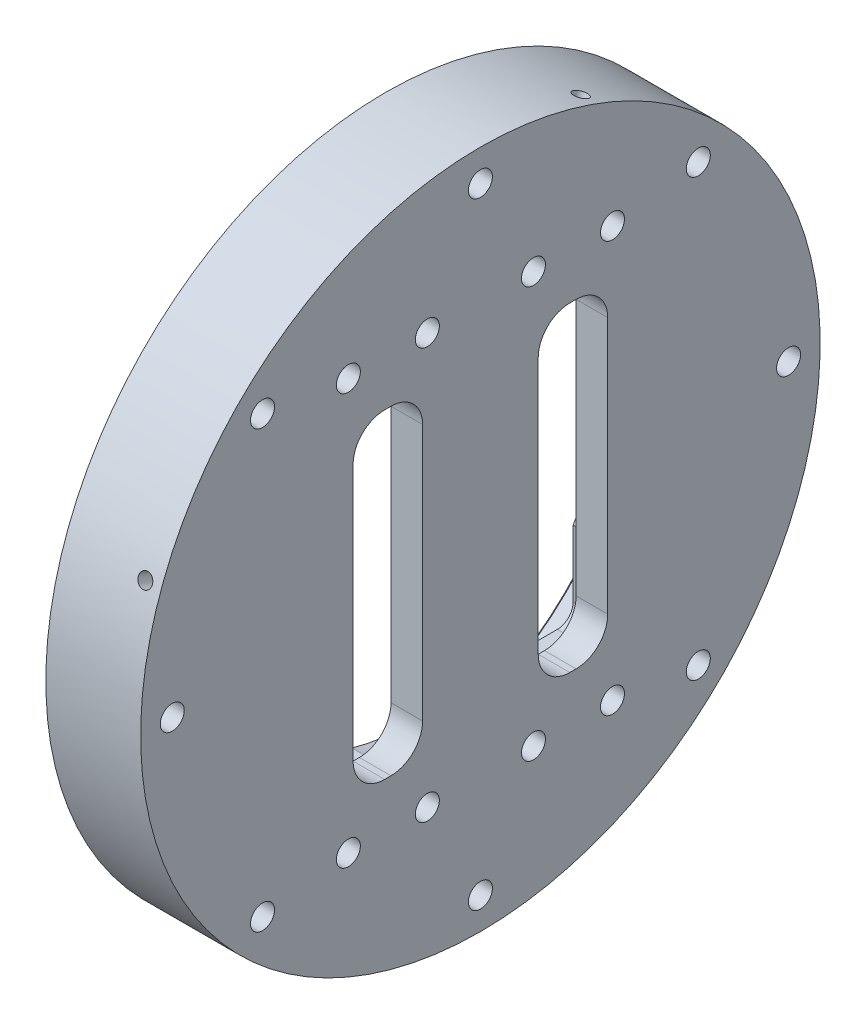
ISO-10303-21;
HEADER;
FILE_DESCRIPTION(('STEP AP214'),'2;1');
FILE_NAME('part.step','',(''),(''),'','','');
FILE_SCHEMA(('AUTOMOTIVE_DESIGN { 1 0 10303 214 1 1 1 1 }'));
ENDSEC;
DATA;
#1=APPLICATION_CONTEXT('core data for automotive mechanical design processes');
#2=APPLICATION_PROTOCOL_DEFINITION('international standard','automotive_design',2000,#1);
#3=PRODUCT_CONTEXT('',#1,'mechanical');
#4=PRODUCT('Part','Part','',(#3));
#5=PRODUCT_RELATED_PRODUCT_CATEGORY('part','',(#4));
#6=PRODUCT_DEFINITION_FORMATION('','',#4);
#7=PRODUCT_DEFINITION_CONTEXT('part definition',#1,'design');
#8=PRODUCT_DEFINITION('design','',#6,#7);
#9=PRODUCT_DEFINITION_SHAPE('','',#8);
#10=(LENGTH_UNIT() NAMED_UNIT(*) SI_UNIT(.MILLI.,.METRE.));
#11=(NAMED_UNIT(*) PLANE_ANGLE_UNIT() SI_UNIT($,.RADIAN.));
#12=(NAMED_UNIT(*) SI_UNIT($,.STERADIAN.) SOLID_ANGLE_UNIT());
#13=UNCERTAINTY_MEASURE_WITH_UNIT(LENGTH_MEASURE(1.E-05),#10,'distance_accuracy_value','');
#14=(GEOMETRIC_REPRESENTATION_CONTEXT(3) GLOBAL_UNCERTAINTY_ASSIGNED_CONTEXT((#13)) GLOBAL_UNIT_ASSIGNED_CONTEXT((#10,
#11,#12)) REPRESENTATION_CONTEXT('',''));
#15=CARTESIAN_POINT('',(0.,0.,0.));
#16=DIRECTION('',(0.,0.,1.));
#17=DIRECTION('',(1.,0.,0.));
#18=AXIS2_PLACEMENT_3D('',#15,#16,#17);
#19=CARTESIAN_POINT('',(-7.25850942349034,0.,0.));
#20=DIRECTION('',(-1.,0.,0.));
#21=DIRECTION('',(0.,-1.,0.));
#22=AXIS2_PLACEMENT_3D('',#19,#20,#21);
#23=CYLINDRICAL_SURFACE('',#22,39.6875);
#24=CARTESIAN_POINT('',(4.34340000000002,0.,0.));
#25=DIRECTION('',(-1.,0.,0.));
#26=DIRECTION('',(0.,-1.,0.));
#27=AXIS2_PLACEMENT_3D('',#24,#25,#26);
#28=CIRCLE('',#27,39.6875);
#29=CARTESIAN_POINT('',(4.3434,38.1,11.1125));
#30=VERTEX_POINT('',#29);
#31=CARTESIAN_POINT('',(4.3434,38.1,-11.1125));
#32=VERTEX_POINT('',#31);
#33=EDGE_CURVE('E1803',#30,#32,#28,.T.);
#34=ORIENTED_EDGE('',*,*,#33,.T.);
#35=DIRECTION('',(-1.,0.,0.));
#36=VECTOR('',#35,1.);
#37=CARTESIAN_POINT('',(-7.25850942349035,38.1,-11.1125));
#38=LINE('',#37,#36);
#39=CARTESIAN_POINT('',(12.7,38.1,-11.1125));
#40=VERTEX_POINT('',#39);
#41=EDGE_CURVE('E388',#32,#40,#38,.F.);
#42=ORIENTED_EDGE('',*,*,#41,.T.);
#43=CARTESIAN_POINT('',(12.7,0.,0.));
#44=DIRECTION('',(-1.,0.,0.));
#45=DIRECTION('',(0.,-1.,0.));
#46=AXIS2_PLACEMENT_3D('',#43,#44,#45);
#47=CIRCLE('',#46,39.6875);
#48=CARTESIAN_POINT('',(12.7,38.1,11.1125));
#49=VERTEX_POINT('',#48);
#50=EDGE_CURVE('E820',#49,#40,#47,.T.);
#51=ORIENTED_EDGE('',*,*,#50,.F.);
#52=DIRECTION('',(-1.,0.,0.));
#53=VECTOR('',#52,1.);
#54=CARTESIAN_POINT('',(-7.25850942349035,38.1,11.1125));
#55=LINE('',#54,#53);
#56=EDGE_CURVE('E385',#49,#30,#55,.T.);
#57=ORIENTED_EDGE('',*,*,#56,.T.);
#58=EDGE_LOOP('',(#34,#42,#51,#57));
#59=FACE_BOUND('',#58,.T.);
#60=ADVANCED_FACE('F34',(#59),#23,.F.);
#61=CARTESIAN_POINT('',(4.34340000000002,-21.5338976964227,33.3375));
#62=VERTEX_POINT('',#61);
#63=CARTESIAN_POINT('',(4.34340000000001,21.5338976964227,33.3375));
#64=VERTEX_POINT('',#63);
#65=EDGE_CURVE('E670',#62,#64,#28,.T.);
#66=ORIENTED_EDGE('',*,*,#65,.T.);
#67=DIRECTION('',(-1.,0.,0.));
#68=VECTOR('',#67,1.);
#69=CARTESIAN_POINT('',(-7.25850942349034,21.5338976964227,33.3375));
#70=LINE('',#69,#68);
#71=CARTESIAN_POINT('',(12.7,21.5338976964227,33.3375));
#72=VERTEX_POINT('',#71);
#73=EDGE_CURVE('E382',#64,#72,#70,.F.);
#74=ORIENTED_EDGE('',*,*,#73,.T.);
#75=CARTESIAN_POINT('',(12.7,-21.5338976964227,33.3375));
#76=VERTEX_POINT('',#75);
#77=EDGE_CURVE('E666',#76,#72,#47,.T.);
#78=ORIENTED_EDGE('',*,*,#77,.F.);
#79=DIRECTION('',(-1.,0.,0.));
#80=VECTOR('',#79,1.);
#81=CARTESIAN_POINT('',(-7.25850942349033,-21.5338976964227,33.3375));
#82=LINE('',#81,#80);
#83=EDGE_CURVE('E379',#76,#62,#82,.T.);
#84=ORIENTED_EDGE('',*,*,#83,.T.);
#85=EDGE_LOOP('',(#66,#74,#78,#84));
#86=FACE_BOUND('',#85,.T.);
#87=ADVANCED_FACE('F774',(#86),#23,.F.);
#88=CARTESIAN_POINT('',(4.34340000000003,-38.1,-11.1125));
#89=VERTEX_POINT('',#88);
#90=CARTESIAN_POINT('',(4.34340000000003,-38.1,11.1125));
#91=VERTEX_POINT('',#90);
#92=EDGE_CURVE('E667',#89,#91,#28,.T.);
#93=ORIENTED_EDGE('',*,*,#92,.T.);
#94=DIRECTION('',(-1.,0.,0.));
#95=VECTOR('',#94,1.);
#96=CARTESIAN_POINT('',(-7.25850942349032,-38.1,11.1125));
#97=LINE('',#96,#95);
#98=CARTESIAN_POINT('',(12.7,-38.1,11.1124999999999));
#99=VERTEX_POINT('',#98);
#100=EDGE_CURVE('E376',#91,#99,#97,.F.);
#101=ORIENTED_EDGE('',*,*,#100,.T.);
#102=CARTESIAN_POINT('',(12.7,-38.1,-11.1124999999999));
#103=VERTEX_POINT('',#102);
#104=EDGE_CURVE('E663',#103,#99,#47,.T.);
#105=ORIENTED_EDGE('',*,*,#104,.F.);
#106=DIRECTION('',(-1.,0.,0.));
#107=VECTOR('',#106,1.);
#108=CARTESIAN_POINT('',(-7.25850942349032,-38.1,-11.1125));
#109=LINE('',#108,#107);
#110=EDGE_CURVE('E373',#103,#89,#109,.T.);
#111=ORIENTED_EDGE('',*,*,#110,.T.);
#112=EDGE_LOOP('',(#93,#101,#105,#111));
#113=FACE_BOUND('',#112,.T.);
#114=ADVANCED_FACE('F781',(#113),#23,.F.);
#115=CARTESIAN_POINT('',(-7.25850942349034,0.,0.));
#116=DIRECTION('',(-1.,0.,0.));
#117=DIRECTION('',(0.,-1.,0.));
#118=AXIS2_PLACEMENT_3D('',#115,#116,#117);
#119=CYLINDRICAL_SURFACE('',#118,50.9905);
#120=CARTESIAN_POINT('',(4.34340000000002,0.,0.));
#121=DIRECTION('',(-1.,0.,0.));
#122=DIRECTION('',(0.,-1.,0.));
#123=AXIS2_PLACEMENT_3D('',#120,#121,#122);
#124=CIRCLE('',#123,50.9905);
#125=CARTESIAN_POINT('',(4.34340000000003,-50.9905,0.));
#126=VERTEX_POINT('',#125);
#127=EDGE_CURVE('E671',#126,#126,#124,.T.);
#128=ORIENTED_EDGE('',*,*,#127,.F.);
#129=EDGE_LOOP('',(#128));
#130=FACE_BOUND('',#129,.T.);
#131=CARTESIAN_POINT('',(0.508000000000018,0.,0.));
#132=DIRECTION('',(-1.,0.,0.));
#133=DIRECTION('',(0.,-1.,0.));
#134=AXIS2_PLACEMENT_3D('',#131,#132,#133);
#135=CIRCLE('',#134,50.9905);
#136=CARTESIAN_POINT('',(0.508000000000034,-50.9905,0.));
#137=VERTEX_POINT('',#136);
#138=EDGE_CURVE('E651',#137,#137,#135,.T.);
#139=ORIENTED_EDGE('',*,*,#138,.T.);
#140=EDGE_LOOP('',(#139));
#141=FACE_BOUND('',#140,.T.);
#142=ADVANCED_FACE('F36',(#130,#141),#119,.F.);
#143=CARTESIAN_POINT('',(4.3434,50.9905,0.));
#144=DIRECTION('',(1.,0.,0.));
#145=DIRECTION('',(0.,1.,0.));
#146=AXIS2_PLACEMENT_3D('',#143,#144,#145);
#147=PLANE('',#146);
#148=ORIENTED_EDGE('',*,*,#33,.F.);
#149=DIRECTION('',(0.,0.,-1.));
#150=VECTOR('',#149,1.);
#151=CARTESIAN_POINT('',(4.34340000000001,38.1,-30.1625));
#152=LINE('',#151,#150);
#153=CARTESIAN_POINT('',(4.34340000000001,38.1,30.1625));
#154=VERTEX_POINT('',#153);
#155=EDGE_CURVE('E332',#154,#30,#152,.T.);
#156=ORIENTED_EDGE('',*,*,#155,.F.);
#157=CARTESIAN_POINT('',(4.34340000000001,34.925,30.1625));
#158=DIRECTION('',(-1.,0.,0.));
#159=DIRECTION('',(0.,1.,0.));
#160=AXIS2_PLACEMENT_3D('',#157,#158,#159);
#161=CIRCLE('',#160,3.175);
#162=CARTESIAN_POINT('',(4.34340000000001,34.925,33.3375));
#163=VERTEX_POINT('',#162);
#164=EDGE_CURVE('E328',#163,#154,#161,.T.);
#165=ORIENTED_EDGE('',*,*,#164,.F.);
#166=DIRECTION('',(0.,1.,0.));
#167=VECTOR('',#166,1.);
#168=CARTESIAN_POINT('',(4.34340000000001,34.925,33.3375));
#169=LINE('',#168,#167);
#170=EDGE_CURVE('E325',#64,#163,#169,.T.);
#171=ORIENTED_EDGE('',*,*,#170,.F.);
#172=ORIENTED_EDGE('',*,*,#65,.F.);
#173=CARTESIAN_POINT('',(4.34340000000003,-34.925,33.3375));
#174=VERTEX_POINT('',#173);
#175=EDGE_CURVE('E326',#174,#62,#169,.T.);
#176=ORIENTED_EDGE('',*,*,#175,.F.);
#177=CARTESIAN_POINT('',(4.34340000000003,-34.925,30.1625));
#178=DIRECTION('',(-1.,0.,0.));
#179=DIRECTION('',(0.,-1.,0.));
#180=AXIS2_PLACEMENT_3D('',#177,#178,#179);
#181=CIRCLE('',#180,3.175);
#182=CARTESIAN_POINT('',(4.34340000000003,-38.1,30.1625));
#183=VERTEX_POINT('',#182);
#184=EDGE_CURVE('E322',#183,#174,#181,.T.);
#185=ORIENTED_EDGE('',*,*,#184,.F.);
#186=DIRECTION('',(0.,0.,1.));
#187=VECTOR('',#186,1.);
#188=CARTESIAN_POINT('',(4.34340000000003,-38.1,-30.1625));
#189=LINE('',#188,#187);
#190=EDGE_CURVE('E316',#91,#183,#189,.T.);
#191=ORIENTED_EDGE('',*,*,#190,.F.);
#192=ORIENTED_EDGE('',*,*,#92,.F.);
#193=CARTESIAN_POINT('',(4.34340000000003,-38.1,-30.1625));
#194=VERTEX_POINT('',#193);
#195=EDGE_CURVE('E320',#194,#89,#189,.T.);
#196=ORIENTED_EDGE('',*,*,#195,.F.);
#197=CARTESIAN_POINT('',(4.34340000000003,-34.925,-30.1625));
#198=DIRECTION('',(-1.,0.,0.));
#199=DIRECTION('',(0.,-1.,0.));
#200=AXIS2_PLACEMENT_3D('',#197,#198,#199);
#201=CIRCLE('',#200,3.175);
#202=CARTESIAN_POINT('',(4.34340000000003,-34.925,-33.3375));
#203=VERTEX_POINT('',#202);
#204=EDGE_CURVE('E313',#203,#194,#201,.T.);
#205=ORIENTED_EDGE('',*,*,#204,.F.);
#206=DIRECTION('',(0.,-1.,0.));
#207=VECTOR('',#206,1.);
#208=CARTESIAN_POINT('',(4.34340000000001,34.925,-33.3375));
#209=LINE('',#208,#207);
#210=CARTESIAN_POINT('',(4.34340000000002,-21.5338976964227,-33.3375));
#211=VERTEX_POINT('',#210);
#212=EDGE_CURVE('E303',#211,#203,#209,.T.);
#213=ORIENTED_EDGE('',*,*,#212,.F.);
#214=CARTESIAN_POINT('',(4.34340000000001,21.5338976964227,-33.3375));
#215=VERTEX_POINT('',#214);
#216=EDGE_CURVE('E312',#215,#211,#28,.T.);
#217=ORIENTED_EDGE('',*,*,#216,.F.);
#218=CARTESIAN_POINT('',(4.34340000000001,34.925,-33.3375));
#219=VERTEX_POINT('',#218);
#220=EDGE_CURVE('E288',#219,#215,#209,.T.);
#221=ORIENTED_EDGE('',*,*,#220,.F.);
#222=CARTESIAN_POINT('',(4.34340000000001,34.925,-30.1625));
#223=DIRECTION('',(-1.,0.,0.));
#224=DIRECTION('',(0.,-1.,0.));
#225=AXIS2_PLACEMENT_3D('',#222,#223,#224);
#226=CIRCLE('',#225,3.175);
#227=CARTESIAN_POINT('',(4.34340000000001,38.1,-30.1625));
#228=VERTEX_POINT('',#227);
#229=EDGE_CURVE('E297',#228,#219,#226,.T.);
#230=ORIENTED_EDGE('',*,*,#229,.F.);
#231=EDGE_CURVE('E331',#32,#228,#152,.T.);
#232=ORIENTED_EDGE('',*,*,#231,.F.);
#233=EDGE_LOOP('',(#148,#156,#165,#171,#172,#176,#185,#191,#192,#196,#205,#213,#217,#221,#230,#232));
#234=FACE_BOUND('',#233,.T.);
#235=ORIENTED_EDGE('',*,*,#127,.T.);
#236=EDGE_LOOP('',(#235));
#237=FACE_BOUND('',#236,.T.);
#238=ADVANCED_FACE('F308',(#234,#237),#147,.F.);
#239=ORIENTED_EDGE('',*,*,#216,.T.);
#240=DIRECTION('',(-1.,0.,0.));
#241=VECTOR('',#240,1.);
#242=CARTESIAN_POINT('',(-7.25850942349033,-21.5338976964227,-33.3375));
#243=LINE('',#242,#241);
#244=CARTESIAN_POINT('',(12.7,-21.5338976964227,-33.3375));
#245=VERTEX_POINT('',#244);
#246=EDGE_CURVE('E370',#211,#245,#243,.F.);
#247=ORIENTED_EDGE('',*,*,#246,.T.);
#248=CARTESIAN_POINT('',(12.7,21.5338976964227,-33.3375));
#249=VERTEX_POINT('',#248);
#250=EDGE_CURVE('E665',#249,#245,#47,.T.);
#251=ORIENTED_EDGE('',*,*,#250,.F.);
#252=DIRECTION('',(-1.,0.,0.));
#253=VECTOR('',#252,1.);
#254=CARTESIAN_POINT('',(-7.25850942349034,21.5338976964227,-33.3375));
#255=LINE('',#254,#253);
#256=EDGE_CURVE('E354',#249,#215,#255,.T.);
#257=ORIENTED_EDGE('',*,*,#256,.T.);
#258=EDGE_LOOP('',(#239,#247,#251,#257));
#259=FACE_BOUND('',#258,.T.);
#260=ADVANCED_FACE('F777',(#259),#23,.F.);
#261=CARTESIAN_POINT('',(12.7,39.6875,0.));
#262=DIRECTION('',(1.,0.,0.));
#263=DIRECTION('',(0.,1.,0.));
#264=AXIS2_PLACEMENT_3D('',#261,#262,#263);
#265=PLANE('',#264);
#266=ORIENTED_EDGE('',*,*,#250,.T.);
#267=DIRECTION('',(0.,-1.,0.));
#268=VECTOR('',#267,1.);
#269=CARTESIAN_POINT('',(12.7,34.925,-33.3375));
#270=LINE('',#269,#268);
#271=CARTESIAN_POINT('',(12.7,-34.925,-33.3375));
#272=VERTEX_POINT('',#271);
#273=EDGE_CURVE('E336',#245,#272,#270,.T.);
#274=ORIENTED_EDGE('',*,*,#273,.T.);
#275=CARTESIAN_POINT('',(12.7,-34.925,-30.1625));
#276=DIRECTION('',(-1.,0.,0.));
#277=DIRECTION('',(0.,-1.,0.));
#278=AXIS2_PLACEMENT_3D('',#275,#276,#277);
#279=CIRCLE('',#278,3.175);
#280=CARTESIAN_POINT('',(12.7,-38.1,-30.1625));
#281=VERTEX_POINT('',#280);
#282=EDGE_CURVE('E338',#272,#281,#279,.T.);
#283=ORIENTED_EDGE('',*,*,#282,.T.);
#284=DIRECTION('',(0.,0.,1.));
#285=VECTOR('',#284,1.);
#286=CARTESIAN_POINT('',(12.7,-38.1,-30.1625));
#287=LINE('',#286,#285);
#288=EDGE_CURVE('E53',#281,#103,#287,.T.);
#289=ORIENTED_EDGE('',*,*,#288,.T.);
#290=ORIENTED_EDGE('',*,*,#104,.T.);
#291=CARTESIAN_POINT('',(12.7,-38.1,30.1625));
#292=VERTEX_POINT('',#291);
#293=EDGE_CURVE('E340',#99,#292,#287,.T.);
#294=ORIENTED_EDGE('',*,*,#293,.T.);
#295=CARTESIAN_POINT('',(12.7,-34.925,30.1625));
#296=DIRECTION('',(-1.,0.,0.));
#297=DIRECTION('',(0.,-1.,0.));
#298=AXIS2_PLACEMENT_3D('',#295,#296,#297);
#299=CIRCLE('',#298,3.175);
#300=CARTESIAN_POINT('',(12.7,-34.925,33.3375));
#301=VERTEX_POINT('',#300);
#302=EDGE_CURVE('E342',#292,#301,#299,.T.);
#303=ORIENTED_EDGE('',*,*,#302,.T.);
#304=DIRECTION('',(0.,1.,0.));
#305=VECTOR('',#304,1.);
#306=CARTESIAN_POINT('',(12.7,34.925,33.3375));
#307=LINE('',#306,#305);
#308=EDGE_CURVE('E346',#301,#76,#307,.T.);
#309=ORIENTED_EDGE('',*,*,#308,.T.);
#310=ORIENTED_EDGE('',*,*,#77,.T.);
#311=CARTESIAN_POINT('',(12.7,34.925,33.3375));
#312=VERTEX_POINT('',#311);
#313=EDGE_CURVE('E345',#72,#312,#307,.T.);
#314=ORIENTED_EDGE('',*,*,#313,.T.);
#315=CARTESIAN_POINT('',(12.7,34.925,30.1625));
#316=DIRECTION('',(-1.,0.,0.));
#317=DIRECTION('',(0.,1.,0.));
#318=AXIS2_PLACEMENT_3D('',#315,#316,#317);
#319=CIRCLE('',#318,3.175);
#320=CARTESIAN_POINT('',(12.7,38.1,30.1625));
#321=VERTEX_POINT('',#320);
#322=EDGE_CURVE('E348',#312,#321,#319,.T.);
#323=ORIENTED_EDGE('',*,*,#322,.T.);
#324=DIRECTION('',(0.,0.,-1.));
#325=VECTOR('',#324,1.);
#326=CARTESIAN_POINT('',(12.7,38.1,-30.1625));
#327=LINE('',#326,#325);
#328=EDGE_CURVE('E293',#321,#49,#327,.T.);
#329=ORIENTED_EDGE('',*,*,#328,.T.);
#330=ORIENTED_EDGE('',*,*,#50,.T.);
#331=CARTESIAN_POINT('',(12.7,38.1,-30.1625));
#332=VERTEX_POINT('',#331);
#333=EDGE_CURVE('E351',#40,#332,#327,.T.);
#334=ORIENTED_EDGE('',*,*,#333,.T.);
#335=CARTESIAN_POINT('',(12.7,34.925,-30.1625));
#336=DIRECTION('',(-1.,0.,0.));
#337=DIRECTION('',(0.,-1.,0.));
#338=AXIS2_PLACEMENT_3D('',#335,#336,#337);
#339=CIRCLE('',#338,3.175);
#340=CARTESIAN_POINT('',(12.7,34.925,-33.3375));
#341=VERTEX_POINT('',#340);
#342=EDGE_CURVE('E334',#332,#341,#339,.T.);
#343=ORIENTED_EDGE('',*,*,#342,.T.);
#344=EDGE_CURVE('E60',#341,#249,#270,.T.);
#345=ORIENTED_EDGE('',*,*,#344,.T.);
#346=EDGE_LOOP('',(#266,#274,#283,#289,#290,#294,#303,#309,#310,#314,#323,#329,#330,#334,#343,#345));
#347=FACE_BOUND('',#346,.T.);
#348=DIRECTION('',(0.,0.,1.));
#349=VECTOR('',#348,1.);
#350=CARTESIAN_POINT('',(12.7,32.1436999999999,0.));
#351=LINE('',#350,#349);
#352=CARTESIAN_POINT('',(12.7,32.1437,-19.23125));
#353=VERTEX_POINT('',#352);
#354=CARTESIAN_POINT('',(12.7,32.1437,-17.96125));
#355=VERTEX_POINT('',#354);
#356=EDGE_CURVE('E581',#353,#355,#351,.T.);
#357=ORIENTED_EDGE('',*,*,#356,.T.);
#358=CARTESIAN_POINT('',(12.7,25.7937,-17.96125));
#359=DIRECTION('',(1.,0.,0.));
#360=DIRECTION('',(0.,1.,0.));
#361=AXIS2_PLACEMENT_3D('',#358,#359,#360);
#362=CIRCLE('',#361,6.35);
#363=CARTESIAN_POINT('',(12.7,25.7937,-11.61125));
#364=VERTEX_POINT('',#363);
#365=EDGE_CURVE('E584',#355,#364,#362,.T.);
#366=ORIENTED_EDGE('',*,*,#365,.T.);
#367=DIRECTION('',(0.,-1.,0.));
#368=VECTOR('',#367,1.);
#369=CARTESIAN_POINT('',(12.7,39.6875,-11.61125));
#370=LINE('',#369,#368);
#371=CARTESIAN_POINT('',(12.7,-25.7937,-11.61125));
#372=VERTEX_POINT('',#371);
#373=EDGE_CURVE('E549',#364,#372,#370,.T.);
#374=ORIENTED_EDGE('',*,*,#373,.T.);
#375=CARTESIAN_POINT('',(12.7,-25.7937,-17.96125));
#376=DIRECTION('',(1.,0.,0.));
#377=DIRECTION('',(0.,1.,0.));
#378=AXIS2_PLACEMENT_3D('',#375,#376,#377);
#379=CIRCLE('',#378,6.35);
#380=CARTESIAN_POINT('',(12.7,-32.1437,-17.96125));
#381=VERTEX_POINT('',#380);
#382=EDGE_CURVE('E566',#372,#381,#379,.T.);
#383=ORIENTED_EDGE('',*,*,#382,.T.);
#384=DIRECTION('',(0.,0.,-1.));
#385=VECTOR('',#384,1.);
#386=CARTESIAN_POINT('',(12.7,-32.1437,0.));
#387=LINE('',#386,#385);
#388=CARTESIAN_POINT('',(12.7,-32.1437,-19.23125));
#389=VERTEX_POINT('',#388);
#390=EDGE_CURVE('E569',#381,#389,#387,.T.);
#391=ORIENTED_EDGE('',*,*,#390,.T.);
#392=CARTESIAN_POINT('',(12.7,-25.7937,-19.23125));
#393=DIRECTION('',(1.,0.,0.));
#394=DIRECTION('',(0.,1.,0.));
#395=AXIS2_PLACEMENT_3D('',#392,#393,#394);
#396=CIRCLE('',#395,6.35);
#397=CARTESIAN_POINT('',(12.7,-25.7937,-25.58125));
#398=VERTEX_POINT('',#397);
#399=EDGE_CURVE('E572',#389,#398,#396,.T.);
#400=ORIENTED_EDGE('',*,*,#399,.T.);
#401=DIRECTION('',(0.,1.,0.));
#402=VECTOR('',#401,1.);
#403=CARTESIAN_POINT('',(12.7,39.6875,-25.58125));
#404=LINE('',#403,#402);
#405=CARTESIAN_POINT('',(12.7,25.7937,-25.58125));
#406=VERTEX_POINT('',#405);
#407=EDGE_CURVE('E575',#398,#406,#404,.T.);
#408=ORIENTED_EDGE('',*,*,#407,.T.);
#409=CARTESIAN_POINT('',(12.7,25.7937,-19.23125));
#410=DIRECTION('',(1.,0.,0.));
#411=DIRECTION('',(0.,1.,0.));
#412=AXIS2_PLACEMENT_3D('',#409,#410,#411);
#413=CIRCLE('',#412,6.35);
#414=EDGE_CURVE('E578',#406,#353,#413,.T.);
#415=ORIENTED_EDGE('',*,*,#414,.T.);
#416=EDGE_LOOP('',(#357,#366,#374,#383,#391,#400,#408,#415));
#417=FACE_BOUND('',#416,.T.);
#418=DIRECTION('',(0.,0.,1.));
#419=VECTOR('',#418,1.);
#420=CARTESIAN_POINT('',(12.7,32.1437000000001,0.));
#421=LINE('',#420,#419);
#422=CARTESIAN_POINT('',(12.7,32.1437,17.9612500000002));
#423=VERTEX_POINT('',#422);
#424=CARTESIAN_POINT('',(12.7,32.1437,19.2312500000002));
#425=VERTEX_POINT('',#424);
#426=EDGE_CURVE('E645',#423,#425,#421,.T.);
#427=ORIENTED_EDGE('',*,*,#426,.T.);
#428=CARTESIAN_POINT('',(12.7,25.7937,19.2312500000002));
#429=DIRECTION('',(1.,0.,0.));
#430=DIRECTION('',(0.,1.,0.));
#431=AXIS2_PLACEMENT_3D('',#428,#429,#430);
#432=CIRCLE('',#431,6.35);
#433=CARTESIAN_POINT('',(12.7,25.7937,25.5812500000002));
#434=VERTEX_POINT('',#433);
#435=EDGE_CURVE('E648',#425,#434,#432,.T.);
#436=ORIENTED_EDGE('',*,*,#435,.T.);
#437=DIRECTION('',(0.,-1.,0.));
#438=VECTOR('',#437,1.);
#439=CARTESIAN_POINT('',(12.7,39.6875,25.5812500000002));
#440=LINE('',#439,#438);
#441=CARTESIAN_POINT('',(12.7,-25.7937,25.5812500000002));
#442=VERTEX_POINT('',#441);
#443=EDGE_CURVE('E613',#434,#442,#440,.T.);
#444=ORIENTED_EDGE('',*,*,#443,.T.);
#445=CARTESIAN_POINT('',(12.7,-25.7937,19.2312500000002));
#446=DIRECTION('',(1.,0.,0.));
#447=DIRECTION('',(0.,1.,0.));
#448=AXIS2_PLACEMENT_3D('',#445,#446,#447);
#449=CIRCLE('',#448,6.35);
#450=CARTESIAN_POINT('',(12.7,-32.1437,19.2312500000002));
#451=VERTEX_POINT('',#450);
#452=EDGE_CURVE('E630',#442,#451,#449,.T.);
#453=ORIENTED_EDGE('',*,*,#452,.T.);
#454=DIRECTION('',(0.,0.,-1.));
#455=VECTOR('',#454,1.);
#456=CARTESIAN_POINT('',(12.7,-32.1437000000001,3.92463839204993E-13));
#457=LINE('',#456,#455);
#458=CARTESIAN_POINT('',(12.7,-32.1437,17.9612500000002));
#459=VERTEX_POINT('',#458);
#460=EDGE_CURVE('E633',#451,#459,#457,.T.);
#461=ORIENTED_EDGE('',*,*,#460,.T.);
#462=CARTESIAN_POINT('',(12.7,-25.7937,17.9612500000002));
#463=DIRECTION('',(1.,0.,0.));
#464=DIRECTION('',(0.,1.,0.));
#465=AXIS2_PLACEMENT_3D('',#462,#463,#464);
#466=CIRCLE('',#465,6.35);
#467=CARTESIAN_POINT('',(12.7,-25.7937,11.6112500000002));
#468=VERTEX_POINT('',#467);
#469=EDGE_CURVE('E636',#459,#468,#466,.T.);
#470=ORIENTED_EDGE('',*,*,#469,.T.);
#471=DIRECTION('',(0.,1.,0.));
#472=VECTOR('',#471,1.);
#473=CARTESIAN_POINT('',(12.7,39.6875,11.6112500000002));
#474=LINE('',#473,#472);
#475=CARTESIAN_POINT('',(12.7,25.7937,11.6112500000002));
#476=VERTEX_POINT('',#475);
#477=EDGE_CURVE('E639',#468,#476,#474,.T.);
#478=ORIENTED_EDGE('',*,*,#477,.T.);
#479=CARTESIAN_POINT('',(12.7,25.7937,17.9612500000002));
#480=DIRECTION('',(1.,0.,0.));
#481=DIRECTION('',(0.,1.,0.));
#482=AXIS2_PLACEMENT_3D('',#479,#480,#481);
#483=CIRCLE('',#482,6.35);
#484=EDGE_CURVE('E642',#476,#423,#483,.T.);
#485=ORIENTED_EDGE('',*,*,#484,.T.);
#486=EDGE_LOOP('',(#427,#436,#444,#453,#461,#470,#478,#485));
#487=FACE_BOUND('',#486,.T.);
#488=ADVANCED_FACE('F786',(#347,#417,#487),#265,.F.);
#489=CARTESIAN_POINT('',(19.05,68.2625,0.));
#490=DIRECTION('',(-1.,0.,0.));
#491=DIRECTION('',(0.,-1.,0.));
#492=AXIS2_PLACEMENT_3D('',#489,#490,#491);
#493=PLANE('',#492);
#494=CARTESIAN_POINT('',(19.05,61.9125,0.));
#495=DIRECTION('',(1.,0.,0.));
#496=DIRECTION('',(0.,0.,-1.));
#497=AXIS2_PLACEMENT_3D('',#494,#495,#496);
#498=CIRCLE('',#497,2.41299999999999);
#499=CARTESIAN_POINT('',(19.05,61.9125,-2.41299999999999));
#500=VERTEX_POINT('',#499);
#501=EDGE_CURVE('E1068',#500,#500,#498,.T.);
#502=ORIENTED_EDGE('',*,*,#501,.F.);
#503=EDGE_LOOP('',(#502));
#504=FACE_BOUND('',#503,.T.);
#505=CARTESIAN_POINT('',(19.05,43.778748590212,-43.7787485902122));
#506=DIRECTION('',(1.,0.,0.));
#507=DIRECTION('',(0.,0.,-1.));
#508=AXIS2_PLACEMENT_3D('',#505,#506,#507);
#509=CIRCLE('',#508,2.41299999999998);
#510=CARTESIAN_POINT('',(19.05,43.778748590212,-46.1917485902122));
#511=VERTEX_POINT('',#510);
#512=EDGE_CURVE('E1072',#511,#511,#509,.T.);
#513=ORIENTED_EDGE('',*,*,#512,.F.);
#514=EDGE_LOOP('',(#513));
#515=FACE_BOUND('',#514,.T.);
#516=CARTESIAN_POINT('',(19.05,-1.853896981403E-13,-61.9125000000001));
#517=DIRECTION('',(1.,0.,0.));
#518=DIRECTION('',(0.,0.,-1.));
#519=AXIS2_PLACEMENT_3D('',#516,#517,#518);
#520=CIRCLE('',#519,2.41299999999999);
#521=CARTESIAN_POINT('',(19.05,-1.853896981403E-13,-64.3255));
#522=VERTEX_POINT('',#521);
#523=EDGE_CURVE('E1076',#522,#522,#520,.T.);
#524=ORIENTED_EDGE('',*,*,#523,.F.);
#525=EDGE_LOOP('',(#524));
#526=FACE_BOUND('',#525,.T.);
#527=CARTESIAN_POINT('',(19.05,-43.7787485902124,-43.7787485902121));
#528=DIRECTION('',(1.,0.,0.));
#529=DIRECTION('',(0.,0.,-1.));
#530=AXIS2_PLACEMENT_3D('',#527,#528,#529);
#531=CIRCLE('',#530,2.41299999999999);
#532=CARTESIAN_POINT('',(19.05,-43.7787485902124,-46.1917485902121));
#533=VERTEX_POINT('',#532);
#534=EDGE_CURVE('E1080',#533,#533,#531,.T.);
#535=ORIENTED_EDGE('',*,*,#534,.F.);
#536=EDGE_LOOP('',(#535));
#537=FACE_BOUND('',#536,.T.);
#538=CARTESIAN_POINT('',(19.05,-61.9125000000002,1.29670579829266E-13));
#539=DIRECTION('',(1.,0.,0.));
#540=DIRECTION('',(0.,0.,-1.));
#541=AXIS2_PLACEMENT_3D('',#538,#539,#540);
#542=CIRCLE('',#541,2.41299999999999);
#543=CARTESIAN_POINT('',(19.05,-61.9125000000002,-2.41299999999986));
#544=VERTEX_POINT('',#543);
#545=EDGE_CURVE('E1084',#544,#544,#542,.T.);
#546=ORIENTED_EDGE('',*,*,#545,.F.);
#547=EDGE_LOOP('',(#546));
#548=FACE_BOUND('',#547,.T.);
#549=CARTESIAN_POINT('',(19.05,-43.7787485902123,43.7787485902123));
#550=DIRECTION('',(1.,0.,0.));
#551=DIRECTION('',(0.,0.,-1.));
#552=AXIS2_PLACEMENT_3D('',#549,#550,#551);
#553=CIRCLE('',#552,2.41299999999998);
#554=CARTESIAN_POINT('',(19.05,-43.7787485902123,41.3657485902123));
#555=VERTEX_POINT('',#554);
#556=EDGE_CURVE('E1088',#555,#555,#553,.T.);
#557=ORIENTED_EDGE('',*,*,#556,.F.);
#558=EDGE_LOOP('',(#557));
#559=FACE_BOUND('',#558,.T.);
#560=CARTESIAN_POINT('',(19.05,0.,61.9125000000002));
#561=DIRECTION('',(1.,0.,0.));
#562=DIRECTION('',(0.,0.,-1.));
#563=AXIS2_PLACEMENT_3D('',#560,#561,#562);
#564=CIRCLE('',#563,2.41299999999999);
#565=CARTESIAN_POINT('',(19.05,0.,59.4995000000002));
#566=VERTEX_POINT('',#565);
#567=EDGE_CURVE('E1092',#566,#566,#564,.T.);
#568=ORIENTED_EDGE('',*,*,#567,.F.);
#569=EDGE_LOOP('',(#568));
#570=FACE_BOUND('',#569,.T.);
#571=CARTESIAN_POINT('',(19.05,43.7787485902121,43.7787485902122));
#572=DIRECTION('',(1.,0.,0.));
#573=DIRECTION('',(0.,0.,-1.));
#574=AXIS2_PLACEMENT_3D('',#571,#572,#573);
#575=CIRCLE('',#574,2.41299999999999);
#576=CARTESIAN_POINT('',(19.05,43.7787485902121,41.3657485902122));
#577=VERTEX_POINT('',#576);
#578=EDGE_CURVE('E304',#577,#577,#575,.T.);
#579=ORIENTED_EDGE('',*,*,#578,.F.);
#580=EDGE_LOOP('',(#579));
#581=FACE_BOUND('',#580,.T.);
#582=CARTESIAN_POINT('',(19.05,41.275,-10.65875));
#583=DIRECTION('',(1.,0.,0.));
#584=DIRECTION('',(0.,0.,-1.));
#585=AXIS2_PLACEMENT_3D('',#582,#583,#584);
#586=CIRCLE('',#585,2.413);
#587=CARTESIAN_POINT('',(19.05,41.275,-13.07175));
#588=VERTEX_POINT('',#587);
#589=EDGE_CURVE('E400',#588,#588,#586,.T.);
#590=ORIENTED_EDGE('',*,*,#589,.F.);
#591=EDGE_LOOP('',(#590));
#592=FACE_BOUND('',#591,.T.);
#593=CARTESIAN_POINT('',(19.05,41.275,-26.53375));
#594=DIRECTION('',(1.,0.,0.));
#595=DIRECTION('',(0.,0.,-1.));
#596=AXIS2_PLACEMENT_3D('',#593,#594,#595);
#597=CIRCLE('',#596,2.413);
#598=CARTESIAN_POINT('',(19.05,41.275,-28.94675));
#599=VERTEX_POINT('',#598);
#600=EDGE_CURVE('E412',#599,#599,#597,.T.);
#601=ORIENTED_EDGE('',*,*,#600,.F.);
#602=EDGE_LOOP('',(#601));
#603=FACE_BOUND('',#602,.T.);
#604=CARTESIAN_POINT('',(19.05,-41.275,-26.53375));
#605=DIRECTION('',(1.,0.,0.));
#606=DIRECTION('',(0.,0.,-1.));
#607=AXIS2_PLACEMENT_3D('',#604,#605,#606);
#608=CIRCLE('',#607,2.413);
#609=CARTESIAN_POINT('',(19.05,-41.275,-28.94675));
#610=VERTEX_POINT('',#609);
#611=EDGE_CURVE('E424',#610,#610,#608,.T.);
#612=ORIENTED_EDGE('',*,*,#611,.F.);
#613=EDGE_LOOP('',(#612));
#614=FACE_BOUND('',#613,.T.);
#615=CARTESIAN_POINT('',(19.05,-41.275,-10.65875));
#616=DIRECTION('',(1.,0.,0.));
#617=DIRECTION('',(0.,0.,-1.));
#618=AXIS2_PLACEMENT_3D('',#615,#616,#617);
#619=CIRCLE('',#618,2.413);
#620=CARTESIAN_POINT('',(19.05,-41.275,-13.07175));
#621=VERTEX_POINT('',#620);
#622=EDGE_CURVE('E436',#621,#621,#619,.T.);
#623=ORIENTED_EDGE('',*,*,#622,.F.);
#624=EDGE_LOOP('',(#623));
#625=FACE_BOUND('',#624,.T.);
#626=CARTESIAN_POINT('',(19.05,41.275,26.53375));
#627=DIRECTION('',(1.,0.,0.));
#628=DIRECTION('',(0.,0.,-1.));
#629=AXIS2_PLACEMENT_3D('',#626,#627,#628);
#630=CIRCLE('',#629,2.413);
#631=CARTESIAN_POINT('',(19.05,41.275,24.12075));
#632=VERTEX_POINT('',#631);
#633=EDGE_CURVE('E448',#632,#632,#630,.T.);
#634=ORIENTED_EDGE('',*,*,#633,.F.);
#635=EDGE_LOOP('',(#634));
#636=FACE_BOUND('',#635,.T.);
#637=CARTESIAN_POINT('',(19.05,41.275,10.65875));
#638=DIRECTION('',(1.,0.,0.));
#639=DIRECTION('',(0.,0.,-1.));
#640=AXIS2_PLACEMENT_3D('',#637,#638,#639);
#641=CIRCLE('',#640,2.413);
#642=CARTESIAN_POINT('',(19.05,41.275,8.24575000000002));
#643=VERTEX_POINT('',#642);
#644=EDGE_CURVE('E460',#643,#643,#641,.T.);
#645=ORIENTED_EDGE('',*,*,#644,.F.);
#646=EDGE_LOOP('',(#645));
#647=FACE_BOUND('',#646,.T.);
#648=CARTESIAN_POINT('',(19.05,-41.275,10.65875));
#649=DIRECTION('',(1.,0.,0.));
#650=DIRECTION('',(0.,0.,-1.));
#651=AXIS2_PLACEMENT_3D('',#648,#649,#650);
#652=CIRCLE('',#651,2.413);
#653=CARTESIAN_POINT('',(19.05,-41.275,8.24575000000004));
#654=VERTEX_POINT('',#653);
#655=EDGE_CURVE('E472',#654,#654,#652,.T.);
#656=ORIENTED_EDGE('',*,*,#655,.F.);
#657=EDGE_LOOP('',(#656));
#658=FACE_BOUND('',#657,.T.);
#659=CARTESIAN_POINT('',(19.05,-41.275,26.53375));
#660=DIRECTION('',(1.,0.,0.));
#661=DIRECTION('',(0.,0.,-1.));
#662=AXIS2_PLACEMENT_3D('',#659,#660,#661);
#663=CIRCLE('',#662,2.413);
#664=CARTESIAN_POINT('',(19.05,-41.275,24.12075));
#665=VERTEX_POINT('',#664);
#666=EDGE_CURVE('E484',#665,#665,#663,.T.);
#667=ORIENTED_EDGE('',*,*,#666,.F.);
#668=EDGE_LOOP('',(#667));
#669=FACE_BOUND('',#668,.T.);
#670=DIRECTION('',(0.,-1.,0.));
#671=VECTOR('',#670,1.);
#672=CARTESIAN_POINT('',(19.05,25.7937,-11.61125));
#673=LINE('',#672,#671);
#674=CARTESIAN_POINT('',(19.05,25.7937,-11.61125));
#675=VERTEX_POINT('',#674);
#676=CARTESIAN_POINT('',(19.05,-25.7937,-11.61125));
#677=VERTEX_POINT('',#676);
#678=EDGE_CURVE('E525',#675,#677,#673,.T.);
#679=ORIENTED_EDGE('',*,*,#678,.F.);
#680=CARTESIAN_POINT('',(19.05,25.7937,-17.96125));
#681=DIRECTION('',(1.,0.,0.));
#682=DIRECTION('',(0.,1.,0.));
#683=AXIS2_PLACEMENT_3D('',#680,#681,#682);
#684=CIRCLE('',#683,6.35);
#685=CARTESIAN_POINT('',(19.05,32.1437,-17.96125));
#686=VERTEX_POINT('',#685);
#687=EDGE_CURVE('E523',#686,#675,#684,.T.);
#688=ORIENTED_EDGE('',*,*,#687,.F.);
#689=DIRECTION('',(0.,0.,1.));
#690=VECTOR('',#689,1.);
#691=CARTESIAN_POINT('',(19.05,32.1437,-17.96125));
#692=LINE('',#691,#690);
#693=CARTESIAN_POINT('',(19.05,32.1437,-19.23125));
#694=VERTEX_POINT('',#693);
#695=EDGE_CURVE('E543',#694,#686,#692,.T.);
#696=ORIENTED_EDGE('',*,*,#695,.F.);
#697=CARTESIAN_POINT('',(19.05,25.7937,-19.23125));
#698=DIRECTION('',(1.,0.,0.));
#699=DIRECTION('',(0.,-1.,0.));
#700=AXIS2_PLACEMENT_3D('',#697,#698,#699);
#701=CIRCLE('',#700,6.35);
#702=CARTESIAN_POINT('',(19.05,25.7937,-25.58125));
#703=VERTEX_POINT('',#702);
#704=EDGE_CURVE('E540',#703,#694,#701,.T.);
#705=ORIENTED_EDGE('',*,*,#704,.F.);
#706=DIRECTION('',(0.,1.,0.));
#707=VECTOR('',#706,1.);
#708=CARTESIAN_POINT('',(19.05,25.7937,-25.58125));
#709=LINE('',#708,#707);
#710=CARTESIAN_POINT('',(19.05,-25.7937,-25.58125));
#711=VERTEX_POINT('',#710);
#712=EDGE_CURVE('E537',#711,#703,#709,.T.);
#713=ORIENTED_EDGE('',*,*,#712,.F.);
#714=CARTESIAN_POINT('',(19.05,-25.7937,-19.23125));
#715=DIRECTION('',(1.,0.,0.));
#716=DIRECTION('',(0.,1.,0.));
#717=AXIS2_PLACEMENT_3D('',#714,#715,#716);
#718=CIRCLE('',#717,6.35);
#719=CARTESIAN_POINT('',(19.05,-32.1437,-19.23125));
#720=VERTEX_POINT('',#719);
#721=EDGE_CURVE('E534',#720,#711,#718,.T.);
#722=ORIENTED_EDGE('',*,*,#721,.F.);
#723=DIRECTION('',(0.,0.,-1.));
#724=VECTOR('',#723,1.);
#725=CARTESIAN_POINT('',(19.05,-32.1437,-17.96125));
#726=LINE('',#725,#724);
#727=CARTESIAN_POINT('',(19.05,-32.1437,-17.96125));
#728=VERTEX_POINT('',#727);
#729=EDGE_CURVE('E531',#728,#720,#726,.T.);
#730=ORIENTED_EDGE('',*,*,#729,.F.);
#731=CARTESIAN_POINT('',(19.05,-25.7937,-17.96125));
#732=DIRECTION('',(1.,0.,0.));
#733=DIRECTION('',(0.,1.,0.));
#734=AXIS2_PLACEMENT_3D('',#731,#732,#733);
#735=CIRCLE('',#734,6.35);
#736=EDGE_CURVE('E528',#677,#728,#735,.T.);
#737=ORIENTED_EDGE('',*,*,#736,.F.);
#738=EDGE_LOOP('',(#679,#688,#696,#705,#713,#722,#730,#737));
#739=FACE_BOUND('',#738,.T.);
#740=DIRECTION('',(0.,-1.,0.));
#741=VECTOR('',#740,1.);
#742=CARTESIAN_POINT('',(19.05,25.7937,25.5812500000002));
#743=LINE('',#742,#741);
#744=CARTESIAN_POINT('',(19.05,25.7937,25.5812500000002));
#745=VERTEX_POINT('',#744);
#746=CARTESIAN_POINT('',(19.05,-25.7937,25.5812500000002));
#747=VERTEX_POINT('',#746);
#748=EDGE_CURVE('E589',#745,#747,#743,.T.);
#749=ORIENTED_EDGE('',*,*,#748,.F.);
#750=CARTESIAN_POINT('',(19.05,25.7937,19.2312500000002));
#751=DIRECTION('',(1.,0.,0.));
#752=DIRECTION('',(0.,1.,0.));
#753=AXIS2_PLACEMENT_3D('',#750,#751,#752);
#754=CIRCLE('',#753,6.35);
#755=CARTESIAN_POINT('',(19.05,32.1437,19.2312500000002));
#756=VERTEX_POINT('',#755);
#757=EDGE_CURVE('E587',#756,#745,#754,.T.);
#758=ORIENTED_EDGE('',*,*,#757,.F.);
#759=DIRECTION('',(0.,0.,1.));
#760=VECTOR('',#759,1.);
#761=CARTESIAN_POINT('',(19.05,32.1437,19.2312500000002));
#762=LINE('',#761,#760);
#763=CARTESIAN_POINT('',(19.05,32.1437,17.9612500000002));
#764=VERTEX_POINT('',#763);
#765=EDGE_CURVE('E607',#764,#756,#762,.T.);
#766=ORIENTED_EDGE('',*,*,#765,.F.);
#767=CARTESIAN_POINT('',(19.05,25.7937,17.9612500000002));
#768=DIRECTION('',(1.,0.,0.));
#769=DIRECTION('',(0.,-1.,0.));
#770=AXIS2_PLACEMENT_3D('',#767,#768,#769);
#771=CIRCLE('',#770,6.35);
#772=CARTESIAN_POINT('',(19.05,25.7937,11.6112500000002));
#773=VERTEX_POINT('',#772);
#774=EDGE_CURVE('E604',#773,#764,#771,.T.);
#775=ORIENTED_EDGE('',*,*,#774,.F.);
#776=DIRECTION('',(0.,1.,0.));
#777=VECTOR('',#776,1.);
#778=CARTESIAN_POINT('',(19.05,25.7937,11.6112500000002));
#779=LINE('',#778,#777);
#780=CARTESIAN_POINT('',(19.05,-25.7937,11.6112500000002));
#781=VERTEX_POINT('',#780);
#782=EDGE_CURVE('E601',#781,#773,#779,.T.);
#783=ORIENTED_EDGE('',*,*,#782,.F.);
#784=CARTESIAN_POINT('',(19.05,-25.7937,17.9612500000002));
#785=DIRECTION('',(1.,0.,0.));
#786=DIRECTION('',(0.,1.,0.));
#787=AXIS2_PLACEMENT_3D('',#784,#785,#786);
#788=CIRCLE('',#787,6.35);
#789=CARTESIAN_POINT('',(19.05,-32.1437,17.9612500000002));
#790=VERTEX_POINT('',#789);
#791=EDGE_CURVE('E598',#790,#781,#788,.T.);
#792=ORIENTED_EDGE('',*,*,#791,.F.);
#793=DIRECTION('',(0.,0.,-1.));
#794=VECTOR('',#793,1.);
#795=CARTESIAN_POINT('',(19.05,-32.1437,19.2312500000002));
#796=LINE('',#795,#794);
#797=CARTESIAN_POINT('',(19.05,-32.1437,19.2312500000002));
#798=VERTEX_POINT('',#797);
#799=EDGE_CURVE('E595',#798,#790,#796,.T.);
#800=ORIENTED_EDGE('',*,*,#799,.F.);
#801=CARTESIAN_POINT('',(19.05,-25.7937,19.2312500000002));
#802=DIRECTION('',(1.,0.,0.));
#803=DIRECTION('',(0.,1.,0.));
#804=AXIS2_PLACEMENT_3D('',#801,#802,#803);
#805=CIRCLE('',#804,6.35);
#806=EDGE_CURVE('E592',#747,#798,#805,.T.);
#807=ORIENTED_EDGE('',*,*,#806,.F.);
#808=EDGE_LOOP('',(#749,#758,#766,#775,#783,#792,#800,#807));
#809=FACE_BOUND('',#808,.T.);
#810=CARTESIAN_POINT('',(19.05,0.,0.));
#811=DIRECTION('',(-1.,0.,0.));
#812=DIRECTION('',(0.,-1.,0.));
#813=AXIS2_PLACEMENT_3D('',#810,#811,#812);
#814=CIRCLE('',#813,68.2625);
#815=CARTESIAN_POINT('',(19.05,-68.2625,0.));
#816=VERTEX_POINT('',#815);
#817=EDGE_CURVE('E660',#816,#816,#814,.T.);
#818=ORIENTED_EDGE('',*,*,#817,.F.);
#819=EDGE_LOOP('',(#818));
#820=FACE_BOUND('',#819,.T.);
#821=ADVANCED_FACE('F769',(#504,#515,#526,#537,#548,#559,#570,#581,#592,#603,#614,#625,#636,
#647,#658,#669,#739,#809,#820),#493,.F.);
#822=CARTESIAN_POINT('',(-7.25850942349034,0.,0.));
#823=DIRECTION('',(-1.,0.,0.));
#824=DIRECTION('',(0.,-1.,0.));
#825=AXIS2_PLACEMENT_3D('',#822,#823,#824);
#826=CYLINDRICAL_SURFACE('',#825,68.2625);
#827=CARTESIAN_POINT('',(15.875,22.0054621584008,64.6183297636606));
#828=CARTESIAN_POINT('',(15.7951124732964,22.0054655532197,64.6183287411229));
#829=CARTESIAN_POINT('',(15.7151672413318,22.0118561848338,64.6161534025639));
#830=CARTESIAN_POINT('',(15.5574791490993,22.0372566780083,64.6074949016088));
#831=CARTESIAN_POINT('',(15.4797390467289,22.0562816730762,64.6010065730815));
#832=CARTESIAN_POINT('',(15.3287684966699,22.1063966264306,64.5838743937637));
#833=CARTESIAN_POINT('',(15.255535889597,22.1374807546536,64.5732325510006));
#834=CARTESIAN_POINT('',(15.1156453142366,22.2108052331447,64.5480482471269));
#835=CARTESIAN_POINT('',(15.0489857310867,22.2530428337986,64.5335067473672));
#836=CARTESIAN_POINT('',(14.9240930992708,22.3474680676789,64.5008687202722));
#837=CARTESIAN_POINT('',(14.8658620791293,22.3996580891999,64.4827713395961));
#838=CARTESIAN_POINT('',(14.7594963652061,22.5124787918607,64.443469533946));
#839=CARTESIAN_POINT('',(14.7113620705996,22.5731098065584,64.4222649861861));
#840=CARTESIAN_POINT('',(14.6265555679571,22.7010719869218,64.3772850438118));
#841=CARTESIAN_POINT('',(14.5898841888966,22.7684036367,64.3535094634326));
#842=CARTESIAN_POINT('',(14.5290500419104,22.907832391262,64.3040091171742));
#843=CARTESIAN_POINT('',(14.50488723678,22.9799294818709,64.2782843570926));
#844=CARTESIAN_POINT('',(14.4697594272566,23.1268175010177,64.2255813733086));
#845=CARTESIAN_POINT('',(14.4587925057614,23.2016080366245,64.1986033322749));
#846=CARTESIAN_POINT('',(14.4503618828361,23.351762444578,64.144138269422));
#847=CARTESIAN_POINT('',(14.4528981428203,23.4271263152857,64.1166512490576));
#848=CARTESIAN_POINT('',(14.4714002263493,23.5762774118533,64.0619571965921));
#849=CARTESIAN_POINT('',(14.4873639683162,23.6500648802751,64.0347501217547));
#850=CARTESIAN_POINT('',(14.5322646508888,23.7939906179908,63.9814098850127));
#851=CARTESIAN_POINT('',(14.5612016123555,23.8641288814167,63.9552767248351));
#852=CARTESIAN_POINT('',(14.6312296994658,23.9987878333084,63.9048688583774));
#853=CARTESIAN_POINT('',(14.6723217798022,24.063308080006,63.880594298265));
#854=CARTESIAN_POINT('',(14.7654929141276,24.1849161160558,63.8346533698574));
#855=CARTESIAN_POINT('',(14.8175719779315,24.2420038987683,63.8129870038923));
#856=CARTESIAN_POINT('',(14.9312505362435,24.3471619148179,63.7729392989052));
#857=CARTESIAN_POINT('',(14.9928518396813,24.3952304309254,63.7545585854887));
#858=CARTESIAN_POINT('',(15.1238198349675,24.4809962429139,63.7216748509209));
#859=CARTESIAN_POINT('',(15.1931865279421,24.5186935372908,63.7071718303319));
#860=CARTESIAN_POINT('',(15.3377172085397,24.5826678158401,63.6825135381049));
#861=CARTESIAN_POINT('',(15.4128812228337,24.6089447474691,63.6723582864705));
#862=CARTESIAN_POINT('',(15.5668724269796,24.649347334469,63.6567282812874));
#863=CARTESIAN_POINT('',(15.6456996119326,24.6634730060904,63.6512535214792));
#864=CARTESIAN_POINT('',(15.8047636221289,24.6791790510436,63.6451655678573));
#865=CARTESIAN_POINT('',(15.8850001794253,24.6807617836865,63.644551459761));
#866=CARTESIAN_POINT('',(16.0446192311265,24.6713441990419,63.6482026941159));
#867=CARTESIAN_POINT('',(16.1240017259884,24.6603438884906,63.6524680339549));
#868=CARTESIAN_POINT('',(16.2796521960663,24.6260673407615,63.6657368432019));
#869=CARTESIAN_POINT('',(16.3559204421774,24.602792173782,63.6747398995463));
#870=CARTESIAN_POINT('',(16.5031857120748,24.5446132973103,63.6971885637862));
#871=CARTESIAN_POINT('',(16.5741827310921,24.5097095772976,63.7106341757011));
#872=CARTESIAN_POINT('',(16.7089018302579,24.4292382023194,63.7415333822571));
#873=CARTESIAN_POINT('',(16.7726228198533,24.3836689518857,63.7589875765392));
#874=CARTESIAN_POINT('',(16.8909700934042,24.2831388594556,63.7973428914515));
#875=CARTESIAN_POINT('',(16.945596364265,24.2281780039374,63.8182440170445));
#876=CARTESIAN_POINT('',(17.0442119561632,24.1103904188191,63.8628369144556));
#877=CARTESIAN_POINT('',(17.0881996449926,24.0475624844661,63.8865291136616));
#878=CARTESIAN_POINT('',(17.1642782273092,23.9158079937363,63.935967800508));
#879=CARTESIAN_POINT('',(17.1963691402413,23.8468814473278,63.9617142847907));
#880=CARTESIAN_POINT('',(17.2477403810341,23.7048742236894,64.0144794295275));
#881=CARTESIAN_POINT('',(17.2670217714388,23.6317938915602,64.0414979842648));
#882=CARTESIAN_POINT('',(17.2922301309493,23.4835373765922,64.09601090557));
#883=CARTESIAN_POINT('',(17.2981570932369,23.4083611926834,64.1235052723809));
#884=CARTESIAN_POINT('',(17.2964881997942,23.2580588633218,64.1781738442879));
#885=CARTESIAN_POINT('',(17.2888949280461,23.1829327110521,64.2053481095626));
#886=CARTESIAN_POINT('',(17.2604064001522,23.0348531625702,64.2586230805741));
#887=CARTESIAN_POINT('',(17.2395111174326,22.9618997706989,64.2847237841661));
#888=CARTESIAN_POINT('',(17.1850118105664,22.8202473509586,64.3351449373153));
#889=CARTESIAN_POINT('',(17.1514075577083,22.7515483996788,64.359465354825));
#890=CARTESIAN_POINT('',(17.0724458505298,22.6203762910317,64.4056855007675));
#891=CARTESIAN_POINT('',(17.0270888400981,22.5579028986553,64.427585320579));
#892=CARTESIAN_POINT('',(16.925904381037,22.4409684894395,64.4684084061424));
#893=CARTESIAN_POINT('',(16.8700760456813,22.3865081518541,64.4873314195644));
#894=CARTESIAN_POINT('',(16.7495173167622,22.2871626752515,64.5217332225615));
#895=CARTESIAN_POINT('',(16.6847847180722,22.2422799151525,64.5372111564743));
#896=CARTESIAN_POINT('',(16.5482369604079,22.1633830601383,64.5643485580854));
#897=CARTESIAN_POINT('',(16.4764178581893,22.1293750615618,64.5760058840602));
#898=CARTESIAN_POINT('',(16.3278189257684,22.0732787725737,64.5952022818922));
#899=CARTESIAN_POINT('',(16.2510451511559,22.0511762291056,64.6027462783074));
#900=CARTESIAN_POINT('',(16.123986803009,22.0254068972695,64.6115350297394));
#901=CARTESIAN_POINT('',(16.0745274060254,22.0179371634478,64.6140803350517));
#902=CARTESIAN_POINT('',(15.9750528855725,22.0079637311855,64.617478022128));
#903=CARTESIAN_POINT('',(15.9250377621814,22.0054600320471,64.6183304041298));
#904=CARTESIAN_POINT('',(15.875,22.0054621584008,64.6183297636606));
#905=B_SPLINE_CURVE_WITH_KNOTS('',3,(#827,#828,#829,#830,#831,#832,#833,#834,#835,#836,#837,
#838,#839,#840,#841,#842,#843,#844,#845,#846,#847,#848,#849,#850,#851,#852,#853,#854,#855,#856,
#857,#858,#859,#860,#861,#862,#863,#864,#865,#866,#867,#868,#869,#870,#871,#872,#873,#874,#875,
#876,#877,#878,#879,#880,#881,#882,#883,#884,#885,#886,#887,#888,#889,#890,#891,#892,#893,#894,
#895,#896,#897,#898,#899,#900,#901,#902,#903,#904),.UNSPECIFIED.,.T.,.F.,(4,2,2,2,2,2,2,2,2,2,2,
2,2,2,2,2,2,2,2,2,2,2,2,2,2,2,2,2,2,2,2,2,2,2,2,2,2,2,4),(0.,0.239479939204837,
0.479247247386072,0.718898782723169,0.958491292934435,1.19814137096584,1.43780092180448,
1.67747780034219,1.91715396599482,2.15679530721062,2.39643596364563,2.63603947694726,
2.87564337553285,3.11526609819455,3.35488903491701,3.59455754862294,3.83422609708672,
4.07389574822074,4.31356507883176,4.55318932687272,4.79281344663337,5.03241667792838,
5.27202012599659,5.51165943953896,5.75129909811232,5.99097549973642,6.23065150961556,
6.47030763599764,6.70996388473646,6.94957433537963,7.18918526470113,7.42880050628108,
7.66840669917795,7.9080331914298,8.14771913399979,8.38753920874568,8.62707153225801,
8.77707044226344,8.92706933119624),.UNSPECIFIED.);
#906=CARTESIAN_POINT('',(15.875,22.0054621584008,64.6183297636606));
#907=VERTEX_POINT('',#906);
#908=EDGE_CURVE('E12',#907,#907,#905,.T.);
#909=ORIENTED_EDGE('',*,*,#908,.T.);
#910=EDGE_LOOP('',(#909));
#911=FACE_BOUND('',#910,.T.);
#912=CARTESIAN_POINT('',(15.875,-22.0054621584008,-64.6183297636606));
#913=CARTESIAN_POINT('',(15.7951124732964,-22.0054655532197,-64.6183287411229));
#914=CARTESIAN_POINT('',(15.7151672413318,-22.0118561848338,-64.6161534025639));
#915=CARTESIAN_POINT('',(15.5574791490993,-22.0372566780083,-64.6074949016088));
#916=CARTESIAN_POINT('',(15.4797390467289,-22.0562816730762,-64.6010065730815));
#917=CARTESIAN_POINT('',(15.3287684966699,-22.1063966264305,-64.5838743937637));
#918=CARTESIAN_POINT('',(15.255535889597,-22.1374807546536,-64.5732325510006));
#919=CARTESIAN_POINT('',(15.1156453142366,-22.2108052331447,-64.5480482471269));
#920=CARTESIAN_POINT('',(15.0489857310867,-22.2530428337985,-64.5335067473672));
#921=CARTESIAN_POINT('',(14.9240930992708,-22.3474680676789,-64.5008687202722));
#922=CARTESIAN_POINT('',(14.8658620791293,-22.3996580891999,-64.4827713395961));
#923=CARTESIAN_POINT('',(14.7594963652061,-22.5124787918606,-64.443469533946));
#924=CARTESIAN_POINT('',(14.7113620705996,-22.5731098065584,-64.4222649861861));
#925=CARTESIAN_POINT('',(14.6265555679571,-22.7010719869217,-64.3772850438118));
#926=CARTESIAN_POINT('',(14.5898841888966,-22.7684036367,-64.3535094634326));
#927=CARTESIAN_POINT('',(14.5290500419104,-22.907832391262,-64.3040091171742));
#928=CARTESIAN_POINT('',(14.50488723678,-22.9799294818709,-64.2782843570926));
#929=CARTESIAN_POINT('',(14.4697594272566,-23.1268175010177,-64.2255813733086));
#930=CARTESIAN_POINT('',(14.4587925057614,-23.2016080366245,-64.1986033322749));
#931=CARTESIAN_POINT('',(14.4503618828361,-23.351762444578,-64.144138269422));
#932=CARTESIAN_POINT('',(14.4528981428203,-23.4271263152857,-64.1166512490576));
#933=CARTESIAN_POINT('',(14.4714002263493,-23.5762774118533,-64.0619571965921));
#934=CARTESIAN_POINT('',(14.4873639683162,-23.650064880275,-64.0347501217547));
#935=CARTESIAN_POINT('',(14.5322646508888,-23.7939906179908,-63.9814098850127));
#936=CARTESIAN_POINT('',(14.5612016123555,-23.8641288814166,-63.9552767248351));
#937=CARTESIAN_POINT('',(14.6312296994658,-23.9987878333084,-63.9048688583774));
#938=CARTESIAN_POINT('',(14.6723217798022,-24.063308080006,-63.880594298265));
#939=CARTESIAN_POINT('',(14.7654929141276,-24.1849161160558,-63.8346533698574));
#940=CARTESIAN_POINT('',(14.8175719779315,-24.2420038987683,-63.8129870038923));
#941=CARTESIAN_POINT('',(14.9312505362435,-24.3471619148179,-63.7729392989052));
#942=CARTESIAN_POINT('',(14.9928518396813,-24.3952304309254,-63.7545585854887));
#943=CARTESIAN_POINT('',(15.1238198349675,-24.4809962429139,-63.7216748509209));
#944=CARTESIAN_POINT('',(15.1931865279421,-24.5186935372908,-63.7071718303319));
#945=CARTESIAN_POINT('',(15.3377172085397,-24.5826678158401,-63.6825135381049));
#946=CARTESIAN_POINT('',(15.4128812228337,-24.6089447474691,-63.6723582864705));
#947=CARTESIAN_POINT('',(15.5668724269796,-24.649347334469,-63.6567282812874));
#948=CARTESIAN_POINT('',(15.6456996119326,-24.6634730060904,-63.6512535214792));
#949=CARTESIAN_POINT('',(15.8047636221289,-24.6791790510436,-63.6451655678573));
#950=CARTESIAN_POINT('',(15.8850001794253,-24.6807617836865,-63.644551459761));
#951=CARTESIAN_POINT('',(16.0446192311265,-24.6713441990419,-63.6482026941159));
#952=CARTESIAN_POINT('',(16.1240017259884,-24.6603438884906,-63.6524680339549));
#953=CARTESIAN_POINT('',(16.2796521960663,-24.6260673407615,-63.6657368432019));
#954=CARTESIAN_POINT('',(16.3559204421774,-24.602792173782,-63.6747398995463));
#955=CARTESIAN_POINT('',(16.5031857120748,-24.5446132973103,-63.6971885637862));
#956=CARTESIAN_POINT('',(16.5741827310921,-24.5097095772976,-63.7106341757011));
#957=CARTESIAN_POINT('',(16.7089018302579,-24.4292382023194,-63.7415333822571));
#958=CARTESIAN_POINT('',(16.7726228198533,-24.3836689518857,-63.7589875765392));
#959=CARTESIAN_POINT('',(16.8909700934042,-24.2831388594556,-63.7973428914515));
#960=CARTESIAN_POINT('',(16.945596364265,-24.2281780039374,-63.8182440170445));
#961=CARTESIAN_POINT('',(17.0442119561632,-24.1103904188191,-63.8628369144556));
#962=CARTESIAN_POINT('',(17.0881996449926,-24.0475624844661,-63.8865291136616));
#963=CARTESIAN_POINT('',(17.1642782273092,-23.9158079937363,-63.935967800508));
#964=CARTESIAN_POINT('',(17.1963691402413,-23.8468814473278,-63.9617142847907));
#965=CARTESIAN_POINT('',(17.2477403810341,-23.7048742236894,-64.0144794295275));
#966=CARTESIAN_POINT('',(17.2670217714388,-23.6317938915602,-64.0414979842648));
#967=CARTESIAN_POINT('',(17.2922301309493,-23.4835373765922,-64.09601090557));
#968=CARTESIAN_POINT('',(17.2981570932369,-23.4083611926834,-64.1235052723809));
#969=CARTESIAN_POINT('',(17.2964881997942,-23.2580588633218,-64.1781738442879));
#970=CARTESIAN_POINT('',(17.2888949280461,-23.1829327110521,-64.2053481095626));
#971=CARTESIAN_POINT('',(17.2604064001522,-23.0348531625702,-64.2586230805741));
#972=CARTESIAN_POINT('',(17.2395111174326,-22.9618997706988,-64.2847237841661));
#973=CARTESIAN_POINT('',(17.1850118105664,-22.8202473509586,-64.3351449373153));
#974=CARTESIAN_POINT('',(17.1514075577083,-22.7515483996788,-64.359465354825));
#975=CARTESIAN_POINT('',(17.0724458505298,-22.6203762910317,-64.4056855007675));
#976=CARTESIAN_POINT('',(17.0270888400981,-22.5579028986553,-64.427585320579));
#977=CARTESIAN_POINT('',(16.925904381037,-22.4409684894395,-64.4684084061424));
#978=CARTESIAN_POINT('',(16.8700760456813,-22.3865081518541,-64.4873314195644));
#979=CARTESIAN_POINT('',(16.7495173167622,-22.2871626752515,-64.5217332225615));
#980=CARTESIAN_POINT('',(16.6847847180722,-22.2422799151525,-64.5372111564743));
#981=CARTESIAN_POINT('',(16.5482369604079,-22.1633830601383,-64.5643485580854));
#982=CARTESIAN_POINT('',(16.4764178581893,-22.1293750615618,-64.5760058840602));
#983=CARTESIAN_POINT('',(16.3278189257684,-22.0732787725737,-64.5952022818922));
#984=CARTESIAN_POINT('',(16.2510451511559,-22.0511762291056,-64.6027462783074));
#985=CARTESIAN_POINT('',(16.123986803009,-22.0254068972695,-64.6115350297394));
#986=CARTESIAN_POINT('',(16.0745274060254,-22.0179371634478,-64.6140803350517));
#987=CARTESIAN_POINT('',(15.9750528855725,-22.0079637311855,-64.617478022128));
#988=CARTESIAN_POINT('',(15.9250377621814,-22.0054600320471,-64.6183304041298));
#989=CARTESIAN_POINT('',(15.875,-22.0054621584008,-64.6183297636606));
#990=B_SPLINE_CURVE_WITH_KNOTS('',3,(#912,#913,#914,#915,#916,#917,#918,#919,#920,#921,#922,
#923,#924,#925,#926,#927,#928,#929,#930,#931,#932,#933,#934,#935,#936,#937,#938,#939,#940,#941,
#942,#943,#944,#945,#946,#947,#948,#949,#950,#951,#952,#953,#954,#955,#956,#957,#958,#959,#960,
#961,#962,#963,#964,#965,#966,#967,#968,#969,#970,#971,#972,#973,#974,#975,#976,#977,#978,#979,
#980,#981,#982,#983,#984,#985,#986,#987,#988,#989),.UNSPECIFIED.,.T.,.F.,(4,2,2,2,2,2,2,2,2,2,2,
2,2,2,2,2,2,2,2,2,2,2,2,2,2,2,2,2,2,2,2,2,2,2,2,2,2,2,4),(0.,0.239479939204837,
0.479247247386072,0.718898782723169,0.958491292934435,1.19814137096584,1.43780092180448,
1.67747780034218,1.91715396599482,2.15679530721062,2.39643596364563,2.63603947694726,
2.87564337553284,3.11526609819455,3.35488903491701,3.59455754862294,3.83422609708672,
4.07389574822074,4.31356507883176,4.55318932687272,4.79281344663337,5.03241667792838,
5.27202012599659,5.51165943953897,5.75129909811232,5.99097549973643,6.23065150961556,
6.47030763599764,6.70996388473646,6.94957433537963,7.18918526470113,7.42880050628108,
7.66840669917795,7.9080331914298,8.14771913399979,8.38753920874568,8.62707153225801,
8.77707044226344,8.92706933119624),.UNSPECIFIED.);
#991=CARTESIAN_POINT('',(15.875,-22.0054621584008,-64.6183297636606));
#992=VERTEX_POINT('',#991);
#993=EDGE_CURVE('E46',#992,#992,#990,.T.);
#994=ORIENTED_EDGE('',*,*,#993,.T.);
#995=EDGE_LOOP('',(#994));
#996=FACE_BOUND('',#995,.T.);
#997=CARTESIAN_POINT('',(15.875,64.6183297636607,-22.0054621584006));
#998=CARTESIAN_POINT('',(15.7951124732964,64.618328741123,-22.0054655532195));
#999=CARTESIAN_POINT('',(15.7151672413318,64.6161534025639,-22.0118561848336));
#1000=CARTESIAN_POINT('',(15.5574791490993,64.6074949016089,-22.0372566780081));
#1001=CARTESIAN_POINT('',(15.4797390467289,64.6010065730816,-22.0562816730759));
#1002=CARTESIAN_POINT('',(15.3287684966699,64.5838743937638,-22.1063966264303));
#1003=CARTESIAN_POINT('',(15.255535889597,64.5732325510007,-22.1374807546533));
#1004=CARTESIAN_POINT('',(15.1156453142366,64.548048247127,-22.2108052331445));
#1005=CARTESIAN_POINT('',(15.0489857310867,64.5335067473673,-22.2530428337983));
#1006=CARTESIAN_POINT('',(14.9240930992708,64.5008687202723,-22.3474680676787));
#1007=CARTESIAN_POINT('',(14.8658620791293,64.4827713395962,-22.3996580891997));
#1008=CARTESIAN_POINT('',(14.7594963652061,64.4434695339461,-22.5124787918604));
#1009=CARTESIAN_POINT('',(14.7113620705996,64.4222649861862,-22.5731098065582));
#1010=CARTESIAN_POINT('',(14.6265555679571,64.3772850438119,-22.7010719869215));
#1011=CARTESIAN_POINT('',(14.5898841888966,64.3535094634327,-22.7684036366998));
#1012=CARTESIAN_POINT('',(14.5290500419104,64.3040091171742,-22.9078323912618));
#1013=CARTESIAN_POINT('',(14.50488723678,64.2782843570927,-22.9799294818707));
#1014=CARTESIAN_POINT('',(14.4697594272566,64.2255813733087,-23.1268175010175));
#1015=CARTESIAN_POINT('',(14.4587925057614,64.198603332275,-23.2016080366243));
#1016=CARTESIAN_POINT('',(14.4503618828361,64.1441382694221,-23.3517624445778));
#1017=CARTESIAN_POINT('',(14.4528981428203,64.1166512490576,-23.4271263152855));
#1018=CARTESIAN_POINT('',(14.4714002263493,64.0619571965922,-23.5762774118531));
#1019=CARTESIAN_POINT('',(14.4873639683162,64.0347501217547,-23.6500648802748));
#1020=CARTESIAN_POINT('',(14.5322646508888,63.9814098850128,-23.7939906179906));
#1021=CARTESIAN_POINT('',(14.5612016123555,63.9552767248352,-23.8641288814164));
#1022=CARTESIAN_POINT('',(14.6312296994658,63.9048688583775,-23.9987878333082));
#1023=CARTESIAN_POINT('',(14.6723217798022,63.8805942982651,-24.0633080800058));
#1024=CARTESIAN_POINT('',(14.7654929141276,63.8346533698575,-24.1849161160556));
#1025=CARTESIAN_POINT('',(14.8175719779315,63.8129870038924,-24.2420038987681));
#1026=CARTESIAN_POINT('',(14.9312505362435,63.7729392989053,-24.3471619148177));
#1027=CARTESIAN_POINT('',(14.9928518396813,63.7545585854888,-24.3952304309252));
#1028=CARTESIAN_POINT('',(15.1238198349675,63.721674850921,-24.4809962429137));
#1029=CARTESIAN_POINT('',(15.1931865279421,63.707171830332,-24.5186935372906));
#1030=CARTESIAN_POINT('',(15.3377172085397,63.682513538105,-24.5826678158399));
#1031=CARTESIAN_POINT('',(15.4128812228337,63.6723582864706,-24.6089447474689));
#1032=CARTESIAN_POINT('',(15.5668724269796,63.6567282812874,-24.6493473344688));
#1033=CARTESIAN_POINT('',(15.6456996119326,63.6512535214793,-24.6634730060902));
#1034=CARTESIAN_POINT('',(15.8047636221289,63.6451655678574,-24.6791790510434));
#1035=CARTESIAN_POINT('',(15.8850001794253,63.6445514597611,-24.6807617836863));
#1036=CARTESIAN_POINT('',(16.0446192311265,63.648202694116,-24.6713441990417));
#1037=CARTESIAN_POINT('',(16.1240017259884,63.652468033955,-24.6603438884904));
#1038=CARTESIAN_POINT('',(16.2796521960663,63.665736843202,-24.6260673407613));
#1039=CARTESIAN_POINT('',(16.3559204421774,63.6747398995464,-24.6027921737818));
#1040=CARTESIAN_POINT('',(16.5031857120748,63.6971885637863,-24.5446132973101));
#1041=CARTESIAN_POINT('',(16.5741827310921,63.7106341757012,-24.5097095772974));
#1042=CARTESIAN_POINT('',(16.7089018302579,63.7415333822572,-24.4292382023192));
#1043=CARTESIAN_POINT('',(16.7726228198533,63.7589875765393,-24.3836689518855));
#1044=CARTESIAN_POINT('',(16.8909700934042,63.7973428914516,-24.2831388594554));
#1045=CARTESIAN_POINT('',(16.945596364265,63.8182440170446,-24.2281780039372));
#1046=CARTESIAN_POINT('',(17.0442119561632,63.8628369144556,-24.1103904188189));
#1047=CARTESIAN_POINT('',(17.0881996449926,63.8865291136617,-24.0475624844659));
#1048=CARTESIAN_POINT('',(17.1642782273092,63.9359678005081,-23.9158079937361));
#1049=CARTESIAN_POINT('',(17.1963691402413,63.9617142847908,-23.8468814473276));
#1050=CARTESIAN_POINT('',(17.2477403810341,64.0144794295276,-23.7048742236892));
#1051=CARTESIAN_POINT('',(17.2670217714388,64.0414979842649,-23.63179389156));
#1052=CARTESIAN_POINT('',(17.2922301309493,64.0960109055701,-23.483537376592));
#1053=CARTESIAN_POINT('',(17.2981570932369,64.123505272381,-23.4083611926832));
#1054=CARTESIAN_POINT('',(17.2964881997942,64.178173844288,-23.2580588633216));
#1055=CARTESIAN_POINT('',(17.2888949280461,64.2053481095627,-23.1829327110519));
#1056=CARTESIAN_POINT('',(17.2604064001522,64.2586230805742,-23.0348531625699));
#1057=CARTESIAN_POINT('',(17.2395111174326,64.2847237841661,-22.9618997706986));
#1058=CARTESIAN_POINT('',(17.1850118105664,64.3351449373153,-22.8202473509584));
#1059=CARTESIAN_POINT('',(17.1514075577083,64.3594653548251,-22.7515483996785));
#1060=CARTESIAN_POINT('',(17.0724458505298,64.4056855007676,-22.6203762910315));
#1061=CARTESIAN_POINT('',(17.0270888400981,64.4275853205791,-22.5579028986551));
#1062=CARTESIAN_POINT('',(16.925904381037,64.4684084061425,-22.4409684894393));
#1063=CARTESIAN_POINT('',(16.8700760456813,64.4873314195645,-22.3865081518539));
#1064=CARTESIAN_POINT('',(16.7495173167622,64.5217332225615,-22.2871626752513));
#1065=CARTESIAN_POINT('',(16.6847847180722,64.5372111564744,-22.2422799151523));
#1066=CARTESIAN_POINT('',(16.5482369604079,64.5643485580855,-22.1633830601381));
#1067=CARTESIAN_POINT('',(16.4764178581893,64.5760058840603,-22.1293750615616));
#1068=CARTESIAN_POINT('',(16.3278189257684,64.5952022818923,-22.0732787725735));
#1069=CARTESIAN_POINT('',(16.2510451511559,64.6027462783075,-22.0511762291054));
#1070=CARTESIAN_POINT('',(16.123986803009,64.6115350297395,-22.0254068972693));
#1071=CARTESIAN_POINT('',(16.0745274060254,64.6140803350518,-22.0179371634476));
#1072=CARTESIAN_POINT('',(15.9750528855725,64.6174780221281,-22.0079637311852));
#1073=CARTESIAN_POINT('',(15.9250377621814,64.6183304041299,-22.0054600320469));
#1074=CARTESIAN_POINT('',(15.875,64.6183297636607,-22.0054621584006));
#1075=B_SPLINE_CURVE_WITH_KNOTS('',3,(#997,#998,#999,#1000,#1001,#1002,#1003,#1004,#1005,#1006,
#1007,#1008,#1009,#1010,#1011,#1012,#1013,#1014,#1015,#1016,#1017,#1018,#1019,#1020,#1021,#1022,
#1023,#1024,#1025,#1026,#1027,#1028,#1029,#1030,#1031,#1032,#1033,#1034,#1035,#1036,#1037,#1038,
#1039,#1040,#1041,#1042,#1043,#1044,#1045,#1046,#1047,#1048,#1049,#1050,#1051,#1052,#1053,#1054,
#1055,#1056,#1057,#1058,#1059,#1060,#1061,#1062,#1063,#1064,#1065,#1066,#1067,#1068,#1069,#1070,
#1071,#1072,#1073,#1074),.UNSPECIFIED.,.T.,.F.,(4,2,2,2,2,2,2,2,2,2,2,2,2,2,2,2,2,2,2,2,2,2,2,2,
2,2,2,2,2,2,2,2,2,2,2,2,2,2,4),(0.,0.239479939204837,0.479247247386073,0.718898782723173,
0.958491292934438,1.19814137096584,1.43780092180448,1.67747780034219,1.91715396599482,
2.15679530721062,2.39643596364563,2.63603947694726,2.87564337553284,3.11526609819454,
3.35488903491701,3.59455754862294,3.83422609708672,4.07389574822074,4.31356507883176,
4.55318932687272,4.79281344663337,5.03241667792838,5.27202012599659,5.51165943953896,
5.75129909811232,5.99097549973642,6.23065150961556,6.47030763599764,6.70996388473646,
6.94957433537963,7.18918526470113,7.42880050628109,7.66840669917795,7.90803319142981,
8.1477191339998,8.38753920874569,8.62707153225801,8.77707044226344,8.92706933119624),.UNSPECIFIED.);
#1076=CARTESIAN_POINT('',(15.875,64.6183297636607,-22.0054621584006));
#1077=VERTEX_POINT('',#1076);
#1078=EDGE_CURVE('E680',#1077,#1077,#1075,.T.);
#1079=ORIENTED_EDGE('',*,*,#1078,.T.);
#1080=EDGE_LOOP('',(#1079));
#1081=FACE_BOUND('',#1080,.T.);
#1082=CARTESIAN_POINT('',(15.875,-64.6183297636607,22.0054621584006));
#1083=CARTESIAN_POINT('',(15.7951124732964,-64.618328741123,22.0054655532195));
#1084=CARTESIAN_POINT('',(15.7151672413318,-64.6161534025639,22.0118561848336));
#1085=CARTESIAN_POINT('',(15.5574791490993,-64.6074949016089,22.037256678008));
#1086=CARTESIAN_POINT('',(15.4797390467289,-64.6010065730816,22.0562816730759));
#1087=CARTESIAN_POINT('',(15.3287684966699,-64.5838743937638,22.1063966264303));
#1088=CARTESIAN_POINT('',(15.255535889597,-64.5732325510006,22.1374807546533));
#1089=CARTESIAN_POINT('',(15.1156453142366,-64.548048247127,22.2108052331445));
#1090=CARTESIAN_POINT('',(15.0489857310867,-64.5335067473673,22.2530428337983));
#1091=CARTESIAN_POINT('',(14.9240930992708,-64.5008687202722,22.3474680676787));
#1092=CARTESIAN_POINT('',(14.8658620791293,-64.4827713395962,22.3996580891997));
#1093=CARTESIAN_POINT('',(14.7594963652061,-64.4434695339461,22.5124787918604));
#1094=CARTESIAN_POINT('',(14.7113620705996,-64.4222649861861,22.5731098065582));
#1095=CARTESIAN_POINT('',(14.6265555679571,-64.3772850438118,22.7010719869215));
#1096=CARTESIAN_POINT('',(14.5898841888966,-64.3535094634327,22.7684036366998));
#1097=CARTESIAN_POINT('',(14.5290500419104,-64.3040091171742,22.9078323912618));
#1098=CARTESIAN_POINT('',(14.50488723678,-64.2782843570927,22.9799294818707));
#1099=CARTESIAN_POINT('',(14.4697594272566,-64.2255813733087,23.1268175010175));
#1100=CARTESIAN_POINT('',(14.4587925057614,-64.198603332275,23.2016080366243));
#1101=CARTESIAN_POINT('',(14.4503618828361,-64.1441382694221,23.3517624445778));
#1102=CARTESIAN_POINT('',(14.4528981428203,-64.1166512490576,23.4271263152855));
#1103=CARTESIAN_POINT('',(14.4714002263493,-64.0619571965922,23.5762774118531));
#1104=CARTESIAN_POINT('',(14.4873639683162,-64.0347501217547,23.6500648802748));
#1105=CARTESIAN_POINT('',(14.5322646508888,-63.9814098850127,23.7939906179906));
#1106=CARTESIAN_POINT('',(14.5612016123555,-63.9552767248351,23.8641288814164));
#1107=CARTESIAN_POINT('',(14.6312296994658,-63.9048688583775,23.9987878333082));
#1108=CARTESIAN_POINT('',(14.6723217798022,-63.880594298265,24.0633080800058));
#1109=CARTESIAN_POINT('',(14.7654929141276,-63.8346533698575,24.1849161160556));
#1110=CARTESIAN_POINT('',(14.8175719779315,-63.8129870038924,24.2420038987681));
#1111=CARTESIAN_POINT('',(14.9312505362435,-63.7729392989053,24.3471619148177));
#1112=CARTESIAN_POINT('',(14.9928518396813,-63.7545585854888,24.3952304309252));
#1113=CARTESIAN_POINT('',(15.1238198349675,-63.7216748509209,24.4809962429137));
#1114=CARTESIAN_POINT('',(15.1931865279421,-63.707171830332,24.5186935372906));
#1115=CARTESIAN_POINT('',(15.3377172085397,-63.682513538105,24.5826678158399));
#1116=CARTESIAN_POINT('',(15.4128812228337,-63.6723582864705,24.6089447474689));
#1117=CARTESIAN_POINT('',(15.5668724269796,-63.6567282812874,24.6493473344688));
#1118=CARTESIAN_POINT('',(15.6456996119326,-63.6512535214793,24.6634730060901));
#1119=CARTESIAN_POINT('',(15.8047636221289,-63.6451655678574,24.6791790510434));
#1120=CARTESIAN_POINT('',(15.8850001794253,-63.6445514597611,24.6807617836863));
#1121=CARTESIAN_POINT('',(16.0446192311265,-63.6482026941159,24.6713441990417));
#1122=CARTESIAN_POINT('',(16.1240017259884,-63.6524680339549,24.6603438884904));
#1123=CARTESIAN_POINT('',(16.2796521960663,-63.665736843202,24.6260673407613));
#1124=CARTESIAN_POINT('',(16.3559204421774,-63.6747398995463,24.6027921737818));
#1125=CARTESIAN_POINT('',(16.5031857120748,-63.6971885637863,24.5446132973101));
#1126=CARTESIAN_POINT('',(16.5741827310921,-63.7106341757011,24.5097095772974));
#1127=CARTESIAN_POINT('',(16.7089018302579,-63.7415333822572,24.4292382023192));
#1128=CARTESIAN_POINT('',(16.7726228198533,-63.7589875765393,24.3836689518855));
#1129=CARTESIAN_POINT('',(16.8909700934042,-63.7973428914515,24.2831388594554));
#1130=CARTESIAN_POINT('',(16.945596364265,-63.8182440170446,24.2281780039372));
#1131=CARTESIAN_POINT('',(17.0442119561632,-63.8628369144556,24.1103904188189));
#1132=CARTESIAN_POINT('',(17.0881996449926,-63.8865291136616,24.0475624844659));
#1133=CARTESIAN_POINT('',(17.1642782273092,-63.9359678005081,23.9158079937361));
#1134=CARTESIAN_POINT('',(17.1963691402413,-63.9617142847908,23.8468814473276));
#1135=CARTESIAN_POINT('',(17.2477403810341,-64.0144794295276,23.7048742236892));
#1136=CARTESIAN_POINT('',(17.2670217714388,-64.0414979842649,23.63179389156));
#1137=CARTESIAN_POINT('',(17.2922301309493,-64.0960109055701,23.483537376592));
#1138=CARTESIAN_POINT('',(17.2981570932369,-64.1235052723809,23.4083611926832));
#1139=CARTESIAN_POINT('',(17.2964881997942,-64.178173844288,23.2580588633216));
#1140=CARTESIAN_POINT('',(17.2888949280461,-64.2053481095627,23.1829327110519));
#1141=CARTESIAN_POINT('',(17.2604064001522,-64.2586230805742,23.0348531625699));
#1142=CARTESIAN_POINT('',(17.2395111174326,-64.2847237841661,22.9618997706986));
#1143=CARTESIAN_POINT('',(17.1850118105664,-64.3351449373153,22.8202473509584));
#1144=CARTESIAN_POINT('',(17.1514075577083,-64.3594653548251,22.7515483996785));
#1145=CARTESIAN_POINT('',(17.0724458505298,-64.4056855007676,22.6203762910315));
#1146=CARTESIAN_POINT('',(17.0270888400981,-64.4275853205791,22.5579028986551));
#1147=CARTESIAN_POINT('',(16.925904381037,-64.4684084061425,22.4409684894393));
#1148=CARTESIAN_POINT('',(16.8700760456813,-64.4873314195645,22.3865081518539));
#1149=CARTESIAN_POINT('',(16.7495173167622,-64.5217332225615,22.2871626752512));
#1150=CARTESIAN_POINT('',(16.6847847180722,-64.5372111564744,22.2422799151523));
#1151=CARTESIAN_POINT('',(16.5482369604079,-64.5643485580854,22.1633830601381));
#1152=CARTESIAN_POINT('',(16.4764178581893,-64.5760058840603,22.1293750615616));
#1153=CARTESIAN_POINT('',(16.3278189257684,-64.5952022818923,22.0732787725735));
#1154=CARTESIAN_POINT('',(16.2510451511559,-64.6027462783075,22.0511762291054));
#1155=CARTESIAN_POINT('',(16.123986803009,-64.6115350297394,22.0254068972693));
#1156=CARTESIAN_POINT('',(16.0745274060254,-64.6140803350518,22.0179371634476));
#1157=CARTESIAN_POINT('',(15.9750528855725,-64.6174780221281,22.0079637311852));
#1158=CARTESIAN_POINT('',(15.9250377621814,-64.6183304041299,22.0054600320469));
#1159=CARTESIAN_POINT('',(15.875,-64.6183297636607,22.0054621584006));
#1160=B_SPLINE_CURVE_WITH_KNOTS('',3,(#1082,#1083,#1084,#1085,#1086,#1087,#1088,#1089,#1090,
#1091,#1092,#1093,#1094,#1095,#1096,#1097,#1098,#1099,#1100,#1101,#1102,#1103,#1104,#1105,#1106,
#1107,#1108,#1109,#1110,#1111,#1112,#1113,#1114,#1115,#1116,#1117,#1118,#1119,#1120,#1121,#1122,
#1123,#1124,#1125,#1126,#1127,#1128,#1129,#1130,#1131,#1132,#1133,#1134,#1135,#1136,#1137,#1138,
#1139,#1140,#1141,#1142,#1143,#1144,#1145,#1146,#1147,#1148,#1149,#1150,#1151,#1152,#1153,#1154,
#1155,#1156,#1157,#1158,#1159),.UNSPECIFIED.,.T.,.F.,(4,2,2,2,2,2,2,2,2,2,2,2,2,2,2,2,2,2,2,2,2,
2,2,2,2,2,2,2,2,2,2,2,2,2,2,2,2,2,4),(0.,0.23947993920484,0.479247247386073,0.718898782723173,
0.958491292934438,1.19814137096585,1.43780092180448,1.67747780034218,1.91715396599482,
2.15679530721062,2.39643596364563,2.63603947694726,2.87564337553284,3.11526609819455,
3.35488903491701,3.59455754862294,3.83422609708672,4.07389574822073,4.31356507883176,
4.55318932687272,4.79281344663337,5.03241667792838,5.27202012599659,5.51165943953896,
5.75129909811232,5.99097549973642,6.23065150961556,6.47030763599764,6.70996388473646,
6.94957433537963,7.18918526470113,7.42880050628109,7.66840669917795,7.9080331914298,
8.1477191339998,8.38753920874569,8.62707153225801,8.77707044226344,8.92706933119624),.UNSPECIFIED.);
#1161=CARTESIAN_POINT('',(15.875,-64.6183297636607,22.0054621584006));
#1162=VERTEX_POINT('',#1161);
#1163=EDGE_CURVE('E674',#1162,#1162,#1160,.T.);
#1164=ORIENTED_EDGE('',*,*,#1163,.T.);
#1165=EDGE_LOOP('',(#1164));
#1166=FACE_BOUND('',#1165,.T.);
#1167=CARTESIAN_POINT('',(0.,0.,0.));
#1168=DIRECTION('',(-1.,0.,0.));
#1169=DIRECTION('',(0.,-1.,0.));
#1170=AXIS2_PLACEMENT_3D('',#1167,#1168,#1169);
#1171=CIRCLE('',#1170,68.2625);
#1172=CARTESIAN_POINT('',(0.,-68.2625,0.));
#1173=VERTEX_POINT('',#1172);
#1174=EDGE_CURVE('E657',#1173,#1173,#1171,.T.);
#1175=ORIENTED_EDGE('',*,*,#1174,.F.);
#1176=EDGE_LOOP('',(#1175));
#1177=FACE_BOUND('',#1176,.T.);
#1178=ORIENTED_EDGE('',*,*,#817,.T.);
#1179=EDGE_LOOP('',(#1178));
#1180=FACE_BOUND('',#1179,.T.);
#1181=ADVANCED_FACE('F684',(#911,#996,#1081,#1166,#1177,#1180),#826,.T.);
#1182=CARTESIAN_POINT('',(0.,68.2625,0.));
#1183=DIRECTION('',(1.,0.,0.));
#1184=DIRECTION('',(0.,1.,0.));
#1185=AXIS2_PLACEMENT_3D('',#1182,#1183,#1184);
#1186=PLANE('',#1185);
#1187=CARTESIAN_POINT('',(0.,61.9125,0.));
#1188=DIRECTION('',(1.,0.,0.));
#1189=DIRECTION('',(0.,0.,-1.));
#1190=AXIS2_PLACEMENT_3D('',#1187,#1188,#1189);
#1191=CIRCLE('',#1190,2.41299999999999);
#1192=CARTESIAN_POINT('',(0.,61.9125,-2.41299999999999));
#1193=VERTEX_POINT('',#1192);
#1194=EDGE_CURVE('E1184',#1193,#1193,#1191,.T.);
#1195=ORIENTED_EDGE('',*,*,#1194,.T.);
#1196=EDGE_LOOP('',(#1195));
#1197=FACE_BOUND('',#1196,.T.);
#1198=CARTESIAN_POINT('',(0.,43.778748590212,-43.7787485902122));
#1199=DIRECTION('',(1.,0.,0.));
#1200=DIRECTION('',(0.,0.,-1.));
#1201=AXIS2_PLACEMENT_3D('',#1198,#1199,#1200);
#1202=CIRCLE('',#1201,2.413);
#1203=CARTESIAN_POINT('',(0.,43.778748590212,-46.1917485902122));
#1204=VERTEX_POINT('',#1203);
#1205=EDGE_CURVE('E1180',#1204,#1204,#1202,.T.);
#1206=ORIENTED_EDGE('',*,*,#1205,.T.);
#1207=EDGE_LOOP('',(#1206));
#1208=FACE_BOUND('',#1207,.T.);
#1209=CARTESIAN_POINT('',(0.,-1.853896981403E-13,-61.9125000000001));
#1210=DIRECTION('',(1.,0.,0.));
#1211=DIRECTION('',(0.,0.,-1.));
#1212=AXIS2_PLACEMENT_3D('',#1209,#1210,#1211);
#1213=CIRCLE('',#1212,2.413);
#1214=CARTESIAN_POINT('',(0.,-1.853896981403E-13,-64.3255));
#1215=VERTEX_POINT('',#1214);
#1216=EDGE_CURVE('E1176',#1215,#1215,#1213,.T.);
#1217=ORIENTED_EDGE('',*,*,#1216,.T.);
#1218=EDGE_LOOP('',(#1217));
#1219=FACE_BOUND('',#1218,.T.);
#1220=CARTESIAN_POINT('',(0.,-43.7787485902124,-43.7787485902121));
#1221=DIRECTION('',(1.,0.,0.));
#1222=DIRECTION('',(0.,0.,-1.));
#1223=AXIS2_PLACEMENT_3D('',#1220,#1221,#1222);
#1224=CIRCLE('',#1223,2.413);
#1225=CARTESIAN_POINT('',(0.,-43.7787485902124,-46.1917485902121));
#1226=VERTEX_POINT('',#1225);
#1227=EDGE_CURVE('E1172',#1226,#1226,#1224,.T.);
#1228=ORIENTED_EDGE('',*,*,#1227,.T.);
#1229=EDGE_LOOP('',(#1228));
#1230=FACE_BOUND('',#1229,.T.);
#1231=CARTESIAN_POINT('',(0.,-61.9125000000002,1.29670579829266E-13));
#1232=DIRECTION('',(1.,0.,0.));
#1233=DIRECTION('',(0.,0.,-1.));
#1234=AXIS2_PLACEMENT_3D('',#1231,#1232,#1233);
#1235=CIRCLE('',#1234,2.413);
#1236=CARTESIAN_POINT('',(0.,-61.9125000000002,-2.41299999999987));
#1237=VERTEX_POINT('',#1236);
#1238=EDGE_CURVE('E1168',#1237,#1237,#1235,.T.);
#1239=ORIENTED_EDGE('',*,*,#1238,.T.);
#1240=EDGE_LOOP('',(#1239));
#1241=FACE_BOUND('',#1240,.T.);
#1242=CARTESIAN_POINT('',(0.,-43.7787485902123,43.7787485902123));
#1243=DIRECTION('',(1.,0.,0.));
#1244=DIRECTION('',(0.,0.,-1.));
#1245=AXIS2_PLACEMENT_3D('',#1242,#1243,#1244);
#1246=CIRCLE('',#1245,2.413);
#1247=CARTESIAN_POINT('',(0.,-43.7787485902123,41.3657485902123));
#1248=VERTEX_POINT('',#1247);
#1249=EDGE_CURVE('E1164',#1248,#1248,#1246,.T.);
#1250=ORIENTED_EDGE('',*,*,#1249,.T.);
#1251=EDGE_LOOP('',(#1250));
#1252=FACE_BOUND('',#1251,.T.);
#1253=CARTESIAN_POINT('',(0.,0.,61.9125000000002));
#1254=DIRECTION('',(1.,0.,0.));
#1255=DIRECTION('',(0.,0.,-1.));
#1256=AXIS2_PLACEMENT_3D('',#1253,#1254,#1255);
#1257=CIRCLE('',#1256,2.413);
#1258=CARTESIAN_POINT('',(0.,0.,59.4995000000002));
#1259=VERTEX_POINT('',#1258);
#1260=EDGE_CURVE('E1160',#1259,#1259,#1257,.T.);
#1261=ORIENTED_EDGE('',*,*,#1260,.T.);
#1262=EDGE_LOOP('',(#1261));
#1263=FACE_BOUND('',#1262,.T.);
#1264=CARTESIAN_POINT('',(0.,43.7787485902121,43.7787485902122));
#1265=DIRECTION('',(1.,0.,0.));
#1266=DIRECTION('',(0.,0.,-1.));
#1267=AXIS2_PLACEMENT_3D('',#1264,#1265,#1266);
#1268=CIRCLE('',#1267,2.413);
#1269=CARTESIAN_POINT('',(0.,43.7787485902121,41.3657485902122));
#1270=VERTEX_POINT('',#1269);
#1271=EDGE_CURVE('E1155',#1270,#1270,#1268,.T.);
#1272=ORIENTED_EDGE('',*,*,#1271,.T.);
#1273=EDGE_LOOP('',(#1272));
#1274=FACE_BOUND('',#1273,.T.);
#1275=CARTESIAN_POINT('',(0.,0.,0.));
#1276=DIRECTION('',(-1.,0.,0.));
#1277=DIRECTION('',(0.,-1.,0.));
#1278=AXIS2_PLACEMENT_3D('',#1275,#1276,#1277);
#1279=CIRCLE('',#1278,51.4985);
#1280=CARTESIAN_POINT('',(0.,-51.4985,0.));
#1281=VERTEX_POINT('',#1280);
#1282=EDGE_CURVE('E654',#1281,#1281,#1279,.T.);
#1283=ORIENTED_EDGE('',*,*,#1282,.F.);
#1284=EDGE_LOOP('',(#1283));
#1285=FACE_BOUND('',#1284,.T.);
#1286=ORIENTED_EDGE('',*,*,#1174,.T.);
#1287=EDGE_LOOP('',(#1286));
#1288=FACE_BOUND('',#1287,.T.);
#1289=ADVANCED_FACE('F762',(#1197,#1208,#1219,#1230,#1241,#1252,#1263,#1274,#1285,#1288),#1186,.F.);
#1290=CARTESIAN_POINT('',(0.,0.,0.));
#1291=DIRECTION('',(-1.,0.,0.));
#1292=DIRECTION('',(0.,-1.,0.));
#1293=AXIS2_PLACEMENT_3D('',#1290,#1291,#1292);
#1294=CONICAL_SURFACE('',#1293,51.4985,0.78539816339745);
#1295=ORIENTED_EDGE('',*,*,#138,.F.);
#1296=EDGE_LOOP('',(#1295));
#1297=FACE_BOUND('',#1296,.T.);
#1298=ORIENTED_EDGE('',*,*,#1282,.T.);
#1299=EDGE_LOOP('',(#1298));
#1300=FACE_BOUND('',#1299,.T.);
#1301=ADVANCED_FACE('F759',(#1297,#1300),#1294,.F.);
#1302=CARTESIAN_POINT('',(0.,25.7937,19.2312500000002));
#1303=DIRECTION('',(1.,0.,0.));
#1304=DIRECTION('',(0.,1.,0.));
#1305=AXIS2_PLACEMENT_3D('',#1302,#1303,#1304);
#1306=CYLINDRICAL_SURFACE('',#1305,6.35);
#1307=DIRECTION('',(1.,0.,0.));
#1308=VECTOR('',#1307,1.);
#1309=CARTESIAN_POINT('',(0.,32.1437,19.2312500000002));
#1310=LINE('',#1309,#1308);
#1311=EDGE_CURVE('E611',#425,#756,#1310,.T.);
#1312=ORIENTED_EDGE('',*,*,#1311,.T.);
#1313=ORIENTED_EDGE('',*,*,#757,.T.);
#1314=DIRECTION('',(1.,0.,0.));
#1315=VECTOR('',#1314,1.);
#1316=CARTESIAN_POINT('',(0.,25.7937,25.5812500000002));
#1317=LINE('',#1316,#1315);
#1318=EDGE_CURVE('E610',#434,#745,#1317,.T.);
#1319=ORIENTED_EDGE('',*,*,#1318,.F.);
#1320=ORIENTED_EDGE('',*,*,#435,.F.);
#1321=EDGE_LOOP('',(#1312,#1313,#1319,#1320));
#1322=FACE_BOUND('',#1321,.T.);
#1323=ADVANCED_FACE('F733',(#1322),#1306,.F.);
#1324=CARTESIAN_POINT('',(0.,32.1437,19.2312500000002));
#1325=DIRECTION('',(0.,1.,0.));
#1326=DIRECTION('',(0.,0.,1.));
#1327=AXIS2_PLACEMENT_3D('',#1324,#1325,#1326);
#1328=PLANE('',#1327);
#1329=DIRECTION('',(1.,0.,0.));
#1330=VECTOR('',#1329,1.);
#1331=CARTESIAN_POINT('',(0.,32.1437,17.9612500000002));
#1332=LINE('',#1331,#1330);
#1333=EDGE_CURVE('E614',#423,#764,#1332,.T.);
#1334=ORIENTED_EDGE('',*,*,#1333,.T.);
#1335=ORIENTED_EDGE('',*,*,#765,.T.);
#1336=ORIENTED_EDGE('',*,*,#1311,.F.);
#1337=ORIENTED_EDGE('',*,*,#426,.F.);
#1338=EDGE_LOOP('',(#1334,#1335,#1336,#1337));
#1339=FACE_BOUND('',#1338,.T.);
#1340=ADVANCED_FACE('F729',(#1339),#1328,.F.);
#1341=CARTESIAN_POINT('',(0.,25.7937,17.9612500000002));
#1342=DIRECTION('',(1.,0.,0.));
#1343=DIRECTION('',(0.,1.,0.));
#1344=AXIS2_PLACEMENT_3D('',#1341,#1342,#1343);
#1345=CYLINDRICAL_SURFACE('',#1344,6.35);
#1346=DIRECTION('',(1.,0.,0.));
#1347=VECTOR('',#1346,1.);
#1348=CARTESIAN_POINT('',(0.,25.7937,11.6112500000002));
#1349=LINE('',#1348,#1347);
#1350=EDGE_CURVE('E616',#476,#773,#1349,.T.);
#1351=ORIENTED_EDGE('',*,*,#1350,.T.);
#1352=ORIENTED_EDGE('',*,*,#774,.T.);
#1353=ORIENTED_EDGE('',*,*,#1333,.F.);
#1354=ORIENTED_EDGE('',*,*,#484,.F.);
#1355=EDGE_LOOP('',(#1351,#1352,#1353,#1354));
#1356=FACE_BOUND('',#1355,.T.);
#1357=ADVANCED_FACE('F732',(#1356),#1345,.F.);
#1358=CARTESIAN_POINT('',(0.,25.7937,11.6112500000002));
#1359=DIRECTION('',(0.,0.,-1.));
#1360=DIRECTION('',(0.,1.,0.));
#1361=AXIS2_PLACEMENT_3D('',#1358,#1359,#1360);
#1362=PLANE('',#1361);
#1363=DIRECTION('',(1.,0.,0.));
#1364=VECTOR('',#1363,1.);
#1365=CARTESIAN_POINT('',(0.,-25.7937,11.6112500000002));
#1366=LINE('',#1365,#1364);
#1367=EDGE_CURVE('E618',#468,#781,#1366,.T.);
#1368=ORIENTED_EDGE('',*,*,#1367,.T.);
#1369=ORIENTED_EDGE('',*,*,#782,.T.);
#1370=ORIENTED_EDGE('',*,*,#1350,.F.);
#1371=ORIENTED_EDGE('',*,*,#477,.F.);
#1372=EDGE_LOOP('',(#1368,#1369,#1370,#1371));
#1373=FACE_BOUND('',#1372,.T.);
#1374=ADVANCED_FACE('F737',(#1373),#1362,.F.);
#1375=CARTESIAN_POINT('',(0.,-25.7937,17.9612500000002));
#1376=DIRECTION('',(1.,0.,0.));
#1377=DIRECTION('',(0.,1.,0.));
#1378=AXIS2_PLACEMENT_3D('',#1375,#1376,#1377);
#1379=CYLINDRICAL_SURFACE('',#1378,6.35);
#1380=DIRECTION('',(1.,0.,0.));
#1381=VECTOR('',#1380,1.);
#1382=CARTESIAN_POINT('',(0.,-32.1437,17.9612500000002));
#1383=LINE('',#1382,#1381);
#1384=EDGE_CURVE('E620',#459,#790,#1383,.T.);
#1385=ORIENTED_EDGE('',*,*,#1384,.T.);
#1386=ORIENTED_EDGE('',*,*,#791,.T.);
#1387=ORIENTED_EDGE('',*,*,#1367,.F.);
#1388=ORIENTED_EDGE('',*,*,#469,.F.);
#1389=EDGE_LOOP('',(#1385,#1386,#1387,#1388));
#1390=FACE_BOUND('',#1389,.T.);
#1391=ADVANCED_FACE('F741',(#1390),#1379,.F.);
#1392=CARTESIAN_POINT('',(0.,-32.1437,19.2312500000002));
#1393=DIRECTION('',(0.,-1.,0.));
#1394=DIRECTION('',(0.,0.,-1.));
#1395=AXIS2_PLACEMENT_3D('',#1392,#1393,#1394);
#1396=PLANE('',#1395);
#1397=DIRECTION('',(1.,0.,0.));
#1398=VECTOR('',#1397,1.);
#1399=CARTESIAN_POINT('',(0.,-32.1437,19.2312500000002));
#1400=LINE('',#1399,#1398);
#1401=EDGE_CURVE('E622',#451,#798,#1400,.T.);
#1402=ORIENTED_EDGE('',*,*,#1401,.T.);
#1403=ORIENTED_EDGE('',*,*,#799,.T.);
#1404=ORIENTED_EDGE('',*,*,#1384,.F.);
#1405=ORIENTED_EDGE('',*,*,#460,.F.);
#1406=EDGE_LOOP('',(#1402,#1403,#1404,#1405));
#1407=FACE_BOUND('',#1406,.T.);
#1408=ADVANCED_FACE('F745',(#1407),#1396,.F.);
#1409=CARTESIAN_POINT('',(0.,-25.7937,19.2312500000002));
#1410=DIRECTION('',(1.,0.,0.));
#1411=DIRECTION('',(0.,1.,0.));
#1412=AXIS2_PLACEMENT_3D('',#1409,#1410,#1411);
#1413=CYLINDRICAL_SURFACE('',#1412,6.35);
#1414=DIRECTION('',(1.,0.,0.));
#1415=VECTOR('',#1414,1.);
#1416=CARTESIAN_POINT('',(0.,-25.7937,25.5812500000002));
#1417=LINE('',#1416,#1415);
#1418=EDGE_CURVE('E624',#442,#747,#1417,.T.);
#1419=ORIENTED_EDGE('',*,*,#1418,.T.);
#1420=ORIENTED_EDGE('',*,*,#806,.T.);
#1421=ORIENTED_EDGE('',*,*,#1401,.F.);
#1422=ORIENTED_EDGE('',*,*,#452,.F.);
#1423=EDGE_LOOP('',(#1419,#1420,#1421,#1422));
#1424=FACE_BOUND('',#1423,.T.);
#1425=ADVANCED_FACE('F749',(#1424),#1413,.F.);
#1426=CARTESIAN_POINT('',(0.,25.7937,25.5812500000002));
#1427=DIRECTION('',(0.,0.,1.));
#1428=DIRECTION('',(0.,-1.,0.));
#1429=AXIS2_PLACEMENT_3D('',#1426,#1427,#1428);
#1430=PLANE('',#1429);
#1431=ORIENTED_EDGE('',*,*,#1318,.T.);
#1432=ORIENTED_EDGE('',*,*,#748,.T.);
#1433=ORIENTED_EDGE('',*,*,#1418,.F.);
#1434=ORIENTED_EDGE('',*,*,#443,.F.);
#1435=EDGE_LOOP('',(#1431,#1432,#1433,#1434));
#1436=FACE_BOUND('',#1435,.T.);
#1437=ADVANCED_FACE('F727',(#1436),#1430,.F.);
#1438=CARTESIAN_POINT('',(0.,25.7937,-17.96125));
#1439=DIRECTION('',(1.,0.,0.));
#1440=DIRECTION('',(0.,1.,0.));
#1441=AXIS2_PLACEMENT_3D('',#1438,#1439,#1440);
#1442=CYLINDRICAL_SURFACE('',#1441,6.35);
#1443=DIRECTION('',(1.,0.,0.));
#1444=VECTOR('',#1443,1.);
#1445=CARTESIAN_POINT('',(0.,32.1437,-17.96125));
#1446=LINE('',#1445,#1444);
#1447=EDGE_CURVE('E547',#355,#686,#1446,.T.);
#1448=ORIENTED_EDGE('',*,*,#1447,.T.);
#1449=ORIENTED_EDGE('',*,*,#687,.T.);
#1450=DIRECTION('',(1.,0.,0.));
#1451=VECTOR('',#1450,1.);
#1452=CARTESIAN_POINT('',(0.,25.7937,-11.61125));
#1453=LINE('',#1452,#1451);
#1454=EDGE_CURVE('E546',#364,#675,#1453,.T.);
#1455=ORIENTED_EDGE('',*,*,#1454,.F.);
#1456=ORIENTED_EDGE('',*,*,#365,.F.);
#1457=EDGE_LOOP('',(#1448,#1449,#1455,#1456));
#1458=FACE_BOUND('',#1457,.T.);
#1459=ADVANCED_FACE('F701',(#1458),#1442,.F.);
#1460=CARTESIAN_POINT('',(0.,32.1437,-17.96125));
#1461=DIRECTION('',(0.,1.,0.));
#1462=DIRECTION('',(0.,0.,1.));
#1463=AXIS2_PLACEMENT_3D('',#1460,#1461,#1462);
#1464=PLANE('',#1463);
#1465=DIRECTION('',(1.,0.,0.));
#1466=VECTOR('',#1465,1.);
#1467=CARTESIAN_POINT('',(0.,32.1437,-19.23125));
#1468=LINE('',#1467,#1466);
#1469=EDGE_CURVE('E550',#353,#694,#1468,.T.);
#1470=ORIENTED_EDGE('',*,*,#1469,.T.);
#1471=ORIENTED_EDGE('',*,*,#695,.T.);
#1472=ORIENTED_EDGE('',*,*,#1447,.F.);
#1473=ORIENTED_EDGE('',*,*,#356,.F.);
#1474=EDGE_LOOP('',(#1470,#1471,#1472,#1473));
#1475=FACE_BOUND('',#1474,.T.);
#1476=ADVANCED_FACE('F697',(#1475),#1464,.F.);
#1477=CARTESIAN_POINT('',(0.,25.7937,-19.23125));
#1478=DIRECTION('',(1.,0.,0.));
#1479=DIRECTION('',(0.,1.,0.));
#1480=AXIS2_PLACEMENT_3D('',#1477,#1478,#1479);
#1481=CYLINDRICAL_SURFACE('',#1480,6.35);
#1482=DIRECTION('',(1.,0.,0.));
#1483=VECTOR('',#1482,1.);
#1484=CARTESIAN_POINT('',(0.,25.7937,-25.58125));
#1485=LINE('',#1484,#1483);
#1486=EDGE_CURVE('E552',#406,#703,#1485,.T.);
#1487=ORIENTED_EDGE('',*,*,#1486,.T.);
#1488=ORIENTED_EDGE('',*,*,#704,.T.);
#1489=ORIENTED_EDGE('',*,*,#1469,.F.);
#1490=ORIENTED_EDGE('',*,*,#414,.F.);
#1491=EDGE_LOOP('',(#1487,#1488,#1489,#1490));
#1492=FACE_BOUND('',#1491,.T.);
#1493=ADVANCED_FACE('F700',(#1492),#1481,.F.);
#1494=CARTESIAN_POINT('',(0.,25.7937,-25.58125));
#1495=DIRECTION('',(0.,0.,-1.));
#1496=DIRECTION('',(0.,1.,0.));
#1497=AXIS2_PLACEMENT_3D('',#1494,#1495,#1496);
#1498=PLANE('',#1497);
#1499=DIRECTION('',(1.,0.,0.));
#1500=VECTOR('',#1499,1.);
#1501=CARTESIAN_POINT('',(0.,-25.7937,-25.58125));
#1502=LINE('',#1501,#1500);
#1503=EDGE_CURVE('E554',#398,#711,#1502,.T.);
#1504=ORIENTED_EDGE('',*,*,#1503,.T.);
#1505=ORIENTED_EDGE('',*,*,#712,.T.);
#1506=ORIENTED_EDGE('',*,*,#1486,.F.);
#1507=ORIENTED_EDGE('',*,*,#407,.F.);
#1508=EDGE_LOOP('',(#1504,#1505,#1506,#1507));
#1509=FACE_BOUND('',#1508,.T.);
#1510=ADVANCED_FACE('F705',(#1509),#1498,.F.);
#1511=CARTESIAN_POINT('',(0.,-25.7937,-19.23125));
#1512=DIRECTION('',(1.,0.,0.));
#1513=DIRECTION('',(0.,1.,0.));
#1514=AXIS2_PLACEMENT_3D('',#1511,#1512,#1513);
#1515=CYLINDRICAL_SURFACE('',#1514,6.35);
#1516=DIRECTION('',(1.,0.,0.));
#1517=VECTOR('',#1516,1.);
#1518=CARTESIAN_POINT('',(0.,-32.1437,-19.23125));
#1519=LINE('',#1518,#1517);
#1520=EDGE_CURVE('E556',#389,#720,#1519,.T.);
#1521=ORIENTED_EDGE('',*,*,#1520,.T.);
#1522=ORIENTED_EDGE('',*,*,#721,.T.);
#1523=ORIENTED_EDGE('',*,*,#1503,.F.);
#1524=ORIENTED_EDGE('',*,*,#399,.F.);
#1525=EDGE_LOOP('',(#1521,#1522,#1523,#1524));
#1526=FACE_BOUND('',#1525,.T.);
#1527=ADVANCED_FACE('F709',(#1526),#1515,.F.);
#1528=CARTESIAN_POINT('',(0.,-32.1437,-17.96125));
#1529=DIRECTION('',(0.,-1.,0.));
#1530=DIRECTION('',(1.,0.,0.));
#1531=AXIS2_PLACEMENT_3D('',#1528,#1529,#1530);
#1532=PLANE('',#1531);
#1533=DIRECTION('',(1.,0.,0.));
#1534=VECTOR('',#1533,1.);
#1535=CARTESIAN_POINT('',(0.,-32.1437,-17.96125));
#1536=LINE('',#1535,#1534);
#1537=EDGE_CURVE('E558',#381,#728,#1536,.T.);
#1538=ORIENTED_EDGE('',*,*,#1537,.T.);
#1539=ORIENTED_EDGE('',*,*,#729,.T.);
#1540=ORIENTED_EDGE('',*,*,#1520,.F.);
#1541=ORIENTED_EDGE('',*,*,#390,.F.);
#1542=EDGE_LOOP('',(#1538,#1539,#1540,#1541));
#1543=FACE_BOUND('',#1542,.T.);
#1544=ADVANCED_FACE('F713',(#1543),#1532,.F.);
#1545=CARTESIAN_POINT('',(0.,-25.7937,-17.96125));
#1546=DIRECTION('',(1.,0.,0.));
#1547=DIRECTION('',(0.,1.,0.));
#1548=AXIS2_PLACEMENT_3D('',#1545,#1546,#1547);
#1549=CYLINDRICAL_SURFACE('',#1548,6.35);
#1550=DIRECTION('',(1.,0.,0.));
#1551=VECTOR('',#1550,1.);
#1552=CARTESIAN_POINT('',(0.,-25.7937,-11.61125));
#1553=LINE('',#1552,#1551);
#1554=EDGE_CURVE('E560',#372,#677,#1553,.T.);
#1555=ORIENTED_EDGE('',*,*,#1554,.T.);
#1556=ORIENTED_EDGE('',*,*,#736,.T.);
#1557=ORIENTED_EDGE('',*,*,#1537,.F.);
#1558=ORIENTED_EDGE('',*,*,#382,.F.);
#1559=EDGE_LOOP('',(#1555,#1556,#1557,#1558));
#1560=FACE_BOUND('',#1559,.T.);
#1561=ADVANCED_FACE('F717',(#1560),#1549,.F.);
#1562=CARTESIAN_POINT('',(0.,25.7937,-11.61125));
#1563=DIRECTION('',(0.,0.,1.));
#1564=DIRECTION('',(0.,-1.,0.));
#1565=AXIS2_PLACEMENT_3D('',#1562,#1563,#1564);
#1566=PLANE('',#1565);
#1567=ORIENTED_EDGE('',*,*,#1454,.T.);
#1568=ORIENTED_EDGE('',*,*,#678,.T.);
#1569=ORIENTED_EDGE('',*,*,#1554,.F.);
#1570=ORIENTED_EDGE('',*,*,#373,.F.);
#1571=EDGE_LOOP('',(#1567,#1568,#1569,#1570));
#1572=FACE_BOUND('',#1571,.T.);
#1573=ADVANCED_FACE('F694',(#1572),#1566,.F.);
#1574=CARTESIAN_POINT('',(15.875,-64.1457675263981,23.3471500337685));
#1575=DIRECTION('',(0.,-0.939692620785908,0.342020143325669));
#1576=DIRECTION('',(0.,-0.342020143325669,-0.939692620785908));
#1577=AXIS2_PLACEMENT_3D('',#1574,#1575,#1576);
#1578=CYLINDRICAL_SURFACE('',#1577,1.4224);
#1579=CARTESIAN_POINT('',(15.875,-58.7992923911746,21.4011922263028));
#1580=DIRECTION('',(0.,-0.939692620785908,0.342020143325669));
#1581=DIRECTION('',(0.,-0.342020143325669,-0.939692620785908));
#1582=AXIS2_PLACEMENT_3D('',#1579,#1580,#1581);
#1583=CIRCLE('',#1582,1.4224);
#1584=CARTESIAN_POINT('',(15.875,-59.285781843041,20.0645734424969));
#1585=VERTEX_POINT('',#1584);
#1586=EDGE_CURVE('E520',#1585,#1585,#1583,.T.);
#1587=ORIENTED_EDGE('',*,*,#1586,.F.);
#1588=EDGE_LOOP('',(#1587));
#1589=FACE_BOUND('',#1588,.T.);
#1590=ORIENTED_EDGE('',*,*,#1163,.F.);
#1591=EDGE_LOOP('',(#1590));
#1592=FACE_BOUND('',#1591,.T.);
#1593=ADVANCED_FACE('F688',(#1589,#1592),#1578,.F.);
#1594=CARTESIAN_POINT('',(17.0053,-58.7992923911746,21.4011922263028));
#1595=DIRECTION('',(0.,0.939692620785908,-0.342020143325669));
#1596=DIRECTION('',(0.,0.342020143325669,0.939692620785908));
#1597=AXIS2_PLACEMENT_3D('',#1594,#1595,#1596);
#1598=PLANE('',#1597);
#1599=CARTESIAN_POINT('',(15.875,-58.7992923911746,21.4011922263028));
#1600=DIRECTION('',(0.,-0.939692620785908,0.342020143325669));
#1601=DIRECTION('',(0.,-0.342020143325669,-0.939692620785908));
#1602=AXIS2_PLACEMENT_3D('',#1599,#1600,#1601);
#1603=CIRCLE('',#1602,1.1303);
#1604=CARTESIAN_POINT('',(15.875,-59.1858777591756,20.3390576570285));
#1605=VERTEX_POINT('',#1604);
#1606=EDGE_CURVE('E517',#1605,#1605,#1603,.T.);
#1607=ORIENTED_EDGE('',*,*,#1606,.F.);
#1608=EDGE_LOOP('',(#1607));
#1609=FACE_BOUND('',#1608,.T.);
#1610=ORIENTED_EDGE('',*,*,#1586,.T.);
#1611=EDGE_LOOP('',(#1610));
#1612=FACE_BOUND('',#1611,.T.);
#1613=ADVANCED_FACE('F693',(#1609,#1612),#1598,.F.);
#1614=CARTESIAN_POINT('',(15.875,-64.1457675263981,23.3471500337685));
#1615=DIRECTION('',(0.,-0.939692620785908,0.342020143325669));
#1616=DIRECTION('',(0.,-0.342020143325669,-0.939692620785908));
#1617=AXIS2_PLACEMENT_3D('',#1614,#1615,#1616);
#1618=CYLINDRICAL_SURFACE('',#1617,1.1303);
#1619=CARTESIAN_POINT('',(15.875,-57.0091779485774,20.7496438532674));
#1620=DIRECTION('',(0.,-0.939692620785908,0.342020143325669));
#1621=DIRECTION('',(0.,-0.342020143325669,-0.939692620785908));
#1622=AXIS2_PLACEMENT_3D('',#1619,#1620,#1621);
#1623=CIRCLE('',#1622,1.1303);
#1624=CARTESIAN_POINT('',(15.875,-57.3957633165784,19.6875092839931));
#1625=VERTEX_POINT('',#1624);
#1626=EDGE_CURVE('E514',#1625,#1625,#1623,.T.);
#1627=ORIENTED_EDGE('',*,*,#1626,.F.);
#1628=EDGE_LOOP('',(#1627));
#1629=FACE_BOUND('',#1628,.T.);
#1630=ORIENTED_EDGE('',*,*,#1606,.T.);
#1631=EDGE_LOOP('',(#1630));
#1632=FACE_BOUND('',#1631,.T.);
#1633=ADVANCED_FACE('F1038',(#1629,#1632),#1618,.F.);
#1634=CARTESIAN_POINT('',(15.875,-57.0091779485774,20.7496438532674));
#1635=DIRECTION('',(0.,-0.939692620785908,0.342020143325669));
#1636=DIRECTION('',(0.,-0.342020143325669,-0.939692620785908));
#1637=AXIS2_PLACEMENT_3D('',#1634,#1635,#1636);
#1638=CONICAL_SURFACE('',#1637,1.1303,1.02974425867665);
#1639=CARTESIAN_POINT('',(15.875,-56.3709831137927,20.5173599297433));
#1640=VERTEX_POINT('',#1639);
#1641=VERTEX_LOOP('',#1640);
#1642=FACE_BOUND('',#1641,.T.);
#1643=ORIENTED_EDGE('',*,*,#1626,.T.);
#1644=EDGE_LOOP('',(#1643));
#1645=FACE_BOUND('',#1644,.T.);
#1646=ADVANCED_FACE('F1029',(#1642,#1645),#1638,.F.);
#1647=CARTESIAN_POINT('',(15.875,64.1457675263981,-23.3471500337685));
#1648=DIRECTION('',(0.,0.939692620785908,-0.342020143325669));
#1649=DIRECTION('',(0.,0.342020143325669,0.939692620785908));
#1650=AXIS2_PLACEMENT_3D('',#1647,#1648,#1649);
#1651=CYLINDRICAL_SURFACE('',#1650,1.4224);
#1652=CARTESIAN_POINT('',(15.875,58.7992923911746,-21.4011922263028));
#1653=DIRECTION('',(0.,0.939692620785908,-0.342020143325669));
#1654=DIRECTION('',(0.,0.342020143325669,0.939692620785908));
#1655=AXIS2_PLACEMENT_3D('',#1652,#1653,#1654);
#1656=CIRCLE('',#1655,1.4224);
#1657=CARTESIAN_POINT('',(15.875,59.285781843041,-20.0645734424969));
#1658=VERTEX_POINT('',#1657);
#1659=EDGE_CURVE('E511',#1658,#1658,#1656,.T.);
#1660=ORIENTED_EDGE('',*,*,#1659,.F.);
#1661=EDGE_LOOP('',(#1660));
#1662=FACE_BOUND('',#1661,.T.);
#1663=ORIENTED_EDGE('',*,*,#1078,.F.);
#1664=EDGE_LOOP('',(#1663));
#1665=FACE_BOUND('',#1664,.T.);
#1666=ADVANCED_FACE('F1026',(#1662,#1665),#1651,.F.);
#1667=CARTESIAN_POINT('',(17.0053,58.7992923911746,-21.4011922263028));
#1668=DIRECTION('',(0.,-0.939692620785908,0.342020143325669));
#1669=DIRECTION('',(0.,-0.342020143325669,-0.939692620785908));
#1670=AXIS2_PLACEMENT_3D('',#1667,#1668,#1669);
#1671=PLANE('',#1670);
#1672=CARTESIAN_POINT('',(15.875,58.7992923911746,-21.4011922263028));
#1673=DIRECTION('',(0.,0.939692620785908,-0.342020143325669));
#1674=DIRECTION('',(0.,0.342020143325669,0.939692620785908));
#1675=AXIS2_PLACEMENT_3D('',#1672,#1673,#1674);
#1676=CIRCLE('',#1675,1.1303);
#1677=CARTESIAN_POINT('',(15.875,59.1858777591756,-20.3390576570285));
#1678=VERTEX_POINT('',#1677);
#1679=EDGE_CURVE('E508',#1678,#1678,#1676,.T.);
#1680=ORIENTED_EDGE('',*,*,#1679,.F.);
#1681=EDGE_LOOP('',(#1680));
#1682=FACE_BOUND('',#1681,.T.);
#1683=ORIENTED_EDGE('',*,*,#1659,.T.);
#1684=EDGE_LOOP('',(#1683));
#1685=FACE_BOUND('',#1684,.T.);
#1686=ADVANCED_FACE('F1028',(#1682,#1685),#1671,.F.);
#1687=CARTESIAN_POINT('',(15.875,64.1457675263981,-23.3471500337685));
#1688=DIRECTION('',(0.,0.939692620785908,-0.342020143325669));
#1689=DIRECTION('',(0.,0.342020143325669,0.939692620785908));
#1690=AXIS2_PLACEMENT_3D('',#1687,#1688,#1689);
#1691=CYLINDRICAL_SURFACE('',#1690,1.1303);
#1692=CARTESIAN_POINT('',(15.875,57.0091779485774,-20.7496438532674));
#1693=DIRECTION('',(0.,0.939692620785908,-0.342020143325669));
#1694=DIRECTION('',(0.,0.342020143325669,0.939692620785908));
#1695=AXIS2_PLACEMENT_3D('',#1692,#1693,#1694);
#1696=CIRCLE('',#1695,1.1303);
#1697=CARTESIAN_POINT('',(15.875,57.3957633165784,-19.6875092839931));
#1698=VERTEX_POINT('',#1697);
#1699=EDGE_CURVE('E505',#1698,#1698,#1696,.T.);
#1700=ORIENTED_EDGE('',*,*,#1699,.F.);
#1701=EDGE_LOOP('',(#1700));
#1702=FACE_BOUND('',#1701,.T.);
#1703=ORIENTED_EDGE('',*,*,#1679,.T.);
#1704=EDGE_LOOP('',(#1703));
#1705=FACE_BOUND('',#1704,.T.);
#1706=ADVANCED_FACE('F1035',(#1702,#1705),#1691,.F.);
#1707=CARTESIAN_POINT('',(15.875,57.0091779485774,-20.7496438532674));
#1708=DIRECTION('',(0.,0.939692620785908,-0.342020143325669));
#1709=DIRECTION('',(0.,0.342020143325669,0.939692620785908));
#1710=AXIS2_PLACEMENT_3D('',#1707,#1708,#1709);
#1711=CONICAL_SURFACE('',#1710,1.1303,1.02974425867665);
#1712=CARTESIAN_POINT('',(15.875,56.3709831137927,-20.5173599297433));
#1713=VERTEX_POINT('',#1712);
#1714=VERTEX_LOOP('',#1713);
#1715=FACE_BOUND('',#1714,.T.);
#1716=ORIENTED_EDGE('',*,*,#1699,.T.);
#1717=EDGE_LOOP('',(#1716));
#1718=FACE_BOUND('',#1717,.T.);
#1719=ADVANCED_FACE('F1013',(#1715,#1718),#1711,.F.);
#1720=CARTESIAN_POINT('',(15.875,-23.3471500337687,-64.145767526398));
#1721=DIRECTION('',(0.,-0.342020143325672,-0.939692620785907));
#1722=DIRECTION('',(0.,0.939692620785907,-0.342020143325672));
#1723=AXIS2_PLACEMENT_3D('',#1720,#1721,#1722);
#1724=CYLINDRICAL_SURFACE('',#1723,1.4224);
#1725=CARTESIAN_POINT('',(15.875,-21.401192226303,-58.7992923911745));
#1726=DIRECTION('',(0.,-0.342020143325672,-0.939692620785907));
#1727=DIRECTION('',(0.,0.939692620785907,-0.342020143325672));
#1728=AXIS2_PLACEMENT_3D('',#1725,#1726,#1727);
#1729=CIRCLE('',#1728,1.4224);
#1730=CARTESIAN_POINT('',(15.875,-20.0645734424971,-59.2857818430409));
#1731=VERTEX_POINT('',#1730);
#1732=EDGE_CURVE('E502',#1731,#1731,#1729,.T.);
#1733=ORIENTED_EDGE('',*,*,#1732,.F.);
#1734=EDGE_LOOP('',(#1733));
#1735=FACE_BOUND('',#1734,.T.);
#1736=ORIENTED_EDGE('',*,*,#993,.F.);
#1737=EDGE_LOOP('',(#1736));
#1738=FACE_BOUND('',#1737,.T.);
#1739=ADVANCED_FACE('F1008',(#1735,#1738),#1724,.F.);
#1740=CARTESIAN_POINT('',(17.0053,-21.401192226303,-58.7992923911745));
#1741=DIRECTION('',(0.,0.342020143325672,0.939692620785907));
#1742=DIRECTION('',(0.,-0.939692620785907,0.342020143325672));
#1743=AXIS2_PLACEMENT_3D('',#1740,#1741,#1742);
#1744=PLANE('',#1743);
#1745=CARTESIAN_POINT('',(15.875,-21.401192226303,-58.7992923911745));
#1746=DIRECTION('',(0.,-0.342020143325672,-0.939692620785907));
#1747=DIRECTION('',(0.,0.939692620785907,-0.342020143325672));
#1748=AXIS2_PLACEMENT_3D('',#1745,#1746,#1747);
#1749=CIRCLE('',#1748,1.1303);
#1750=CARTESIAN_POINT('',(15.875,-20.3390576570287,-59.1858777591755));
#1751=VERTEX_POINT('',#1750);
#1752=EDGE_CURVE('E499',#1751,#1751,#1749,.T.);
#1753=ORIENTED_EDGE('',*,*,#1752,.F.);
#1754=EDGE_LOOP('',(#1753));
#1755=FACE_BOUND('',#1754,.T.);
#1756=ORIENTED_EDGE('',*,*,#1732,.T.);
#1757=EDGE_LOOP('',(#1756));
#1758=FACE_BOUND('',#1757,.T.);
#1759=ADVANCED_FACE('F1004',(#1755,#1758),#1744,.F.);
#1760=CARTESIAN_POINT('',(15.875,-23.3471500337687,-64.145767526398));
#1761=DIRECTION('',(0.,-0.342020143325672,-0.939692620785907));
#1762=DIRECTION('',(0.,0.939692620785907,-0.342020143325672));
#1763=AXIS2_PLACEMENT_3D('',#1760,#1761,#1762);
#1764=CYLINDRICAL_SURFACE('',#1763,1.1303);
#1765=CARTESIAN_POINT('',(15.875,-20.7496438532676,-57.0091779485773));
#1766=DIRECTION('',(0.,-0.342020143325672,-0.939692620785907));
#1767=DIRECTION('',(0.,0.939692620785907,-0.342020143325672));
#1768=AXIS2_PLACEMENT_3D('',#1765,#1766,#1767);
#1769=CIRCLE('',#1768,1.1303);
#1770=CARTESIAN_POINT('',(15.875,-19.6875092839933,-57.3957633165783));
#1771=VERTEX_POINT('',#1770);
#1772=EDGE_CURVE('E496',#1771,#1771,#1769,.T.);
#1773=ORIENTED_EDGE('',*,*,#1772,.F.);
#1774=EDGE_LOOP('',(#1773));
#1775=FACE_BOUND('',#1774,.T.);
#1776=ORIENTED_EDGE('',*,*,#1752,.T.);
#1777=EDGE_LOOP('',(#1776));
#1778=FACE_BOUND('',#1777,.T.);
#1779=ADVANCED_FACE('F1000',(#1775,#1778),#1764,.F.);
#1780=CARTESIAN_POINT('',(15.875,-20.7496438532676,-57.0091779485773));
#1781=DIRECTION('',(0.,-0.342020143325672,-0.939692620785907));
#1782=DIRECTION('',(0.,0.939692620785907,-0.342020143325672));
#1783=AXIS2_PLACEMENT_3D('',#1780,#1781,#1782);
#1784=CONICAL_SURFACE('',#1783,1.1303,1.02974425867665);
#1785=CARTESIAN_POINT('',(15.875,-20.5173599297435,-56.3709831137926));
#1786=VERTEX_POINT('',#1785);
#1787=VERTEX_LOOP('',#1786);
#1788=FACE_BOUND('',#1787,.T.);
#1789=ORIENTED_EDGE('',*,*,#1772,.T.);
#1790=EDGE_LOOP('',(#1789));
#1791=FACE_BOUND('',#1790,.T.);
#1792=ADVANCED_FACE('F996',(#1788,#1791),#1784,.F.);
#1793=CARTESIAN_POINT('',(15.875,23.3471500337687,64.145767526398));
#1794=DIRECTION('',(0.,0.342020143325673,0.939692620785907));
#1795=DIRECTION('',(0.,-0.939692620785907,0.342020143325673));
#1796=AXIS2_PLACEMENT_3D('',#1793,#1794,#1795);
#1797=CYLINDRICAL_SURFACE('',#1796,1.4224);
#1798=CARTESIAN_POINT('',(15.875,21.401192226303,58.7992923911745));
#1799=DIRECTION('',(0.,0.342020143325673,0.939692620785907));
#1800=DIRECTION('',(0.,-0.939692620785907,0.342020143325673));
#1801=AXIS2_PLACEMENT_3D('',#1798,#1799,#1800);
#1802=CIRCLE('',#1801,1.4224);
#1803=CARTESIAN_POINT('',(15.875,20.0645734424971,59.2857818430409));
#1804=VERTEX_POINT('',#1803);
#1805=EDGE_CURVE('E493',#1804,#1804,#1802,.T.);
#1806=ORIENTED_EDGE('',*,*,#1805,.F.);
#1807=EDGE_LOOP('',(#1806));
#1808=FACE_BOUND('',#1807,.T.);
#1809=ORIENTED_EDGE('',*,*,#908,.F.);
#1810=EDGE_LOOP('',(#1809));
#1811=FACE_BOUND('',#1810,.T.);
#1812=ADVANCED_FACE('F991',(#1808,#1811),#1797,.F.);
#1813=CARTESIAN_POINT('',(17.0053,21.401192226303,58.7992923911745));
#1814=DIRECTION('',(0.,-0.342020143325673,-0.939692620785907));
#1815=DIRECTION('',(0.,0.939692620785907,-0.342020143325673));
#1816=AXIS2_PLACEMENT_3D('',#1813,#1814,#1815);
#1817=PLANE('',#1816);
#1818=CARTESIAN_POINT('',(15.875,21.401192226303,58.7992923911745));
#1819=DIRECTION('',(0.,0.342020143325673,0.939692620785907));
#1820=DIRECTION('',(0.,-0.939692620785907,0.342020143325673));
#1821=AXIS2_PLACEMENT_3D('',#1818,#1819,#1820);
#1822=CIRCLE('',#1821,1.1303);
#1823=CARTESIAN_POINT('',(15.875,20.3390576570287,59.1858777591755));
#1824=VERTEX_POINT('',#1823);
#1825=EDGE_CURVE('E490',#1824,#1824,#1822,.T.);
#1826=ORIENTED_EDGE('',*,*,#1825,.F.);
#1827=EDGE_LOOP('',(#1826));
#1828=FACE_BOUND('',#1827,.T.);
#1829=ORIENTED_EDGE('',*,*,#1805,.T.);
#1830=EDGE_LOOP('',(#1829));
#1831=FACE_BOUND('',#1830,.T.);
#1832=ADVANCED_FACE('F988',(#1828,#1831),#1817,.F.);
#1833=CARTESIAN_POINT('',(15.875,23.3471500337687,64.145767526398));
#1834=DIRECTION('',(0.,0.342020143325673,0.939692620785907));
#1835=DIRECTION('',(0.,-0.939692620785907,0.342020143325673));
#1836=AXIS2_PLACEMENT_3D('',#1833,#1834,#1835);
#1837=CYLINDRICAL_SURFACE('',#1836,1.1303);
#1838=CARTESIAN_POINT('',(15.875,20.7496438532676,57.0091779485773));
#1839=DIRECTION('',(0.,0.342020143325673,0.939692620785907));
#1840=DIRECTION('',(0.,-0.939692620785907,0.342020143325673));
#1841=AXIS2_PLACEMENT_3D('',#1838,#1839,#1840);
#1842=CIRCLE('',#1841,1.1303);
#1843=CARTESIAN_POINT('',(15.875,19.6875092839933,57.3957633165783));
#1844=VERTEX_POINT('',#1843);
#1845=EDGE_CURVE('E487',#1844,#1844,#1842,.T.);
#1846=ORIENTED_EDGE('',*,*,#1845,.F.);
#1847=EDGE_LOOP('',(#1846));
#1848=FACE_BOUND('',#1847,.T.);
#1849=ORIENTED_EDGE('',*,*,#1825,.T.);
#1850=EDGE_LOOP('',(#1849));
#1851=FACE_BOUND('',#1850,.T.);
#1852=ADVANCED_FACE('F984',(#1848,#1851),#1837,.F.);
#1853=CARTESIAN_POINT('',(15.875,20.7496438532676,57.0091779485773));
#1854=DIRECTION('',(0.,0.342020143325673,0.939692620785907));
#1855=DIRECTION('',(0.,-0.939692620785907,0.342020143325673));
#1856=AXIS2_PLACEMENT_3D('',#1853,#1854,#1855);
#1857=CONICAL_SURFACE('',#1856,1.1303,1.02974425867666);
#1858=CARTESIAN_POINT('',(15.875,20.5173599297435,56.3709831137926));
#1859=VERTEX_POINT('',#1858);
#1860=VERTEX_LOOP('',#1859);
#1861=FACE_BOUND('',#1860,.T.);
#1862=ORIENTED_EDGE('',*,*,#1845,.T.);
#1863=EDGE_LOOP('',(#1862));
#1864=FACE_BOUND('',#1863,.T.);
#1865=ADVANCED_FACE('F980',(#1861,#1864),#1857,.F.);
#1866=CARTESIAN_POINT('',(19.05,-41.275,26.53375));
#1867=DIRECTION('',(1.,0.,0.));
#1868=DIRECTION('',(0.,0.,-1.));
#1869=AXIS2_PLACEMENT_3D('',#1866,#1867,#1868);
#1870=CYLINDRICAL_SURFACE('',#1869,2.413);
#1871=CARTESIAN_POINT('',(9.39800000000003,-41.275,26.53375));
#1872=DIRECTION('',(1.,0.,0.));
#1873=DIRECTION('',(0.,0.,-1.));
#1874=AXIS2_PLACEMENT_3D('',#1871,#1872,#1873);
#1875=CIRCLE('',#1874,2.413);
#1876=CARTESIAN_POINT('',(9.39800000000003,-41.275,24.12075));
#1877=VERTEX_POINT('',#1876);
#1878=EDGE_CURVE('E481',#1877,#1877,#1875,.T.);
#1879=ORIENTED_EDGE('',*,*,#1878,.F.);
#1880=EDGE_LOOP('',(#1879));
#1881=FACE_BOUND('',#1880,.T.);
#1882=ORIENTED_EDGE('',*,*,#666,.T.);
#1883=EDGE_LOOP('',(#1882));
#1884=FACE_BOUND('',#1883,.T.);
#1885=ADVANCED_FACE('F976',(#1881,#1884),#1870,.F.);
#1886=CARTESIAN_POINT('',(9.39800000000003,-39.2557,26.53375));
#1887=DIRECTION('',(-1.,0.,0.));
#1888=DIRECTION('',(0.,0.,1.));
#1889=AXIS2_PLACEMENT_3D('',#1886,#1887,#1888);
#1890=PLANE('',#1889);
#1891=CARTESIAN_POINT('',(9.39800000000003,-41.275,26.53375));
#1892=DIRECTION('',(1.,0.,0.));
#1893=DIRECTION('',(0.,0.,-1.));
#1894=AXIS2_PLACEMENT_3D('',#1891,#1892,#1893);
#1895=CIRCLE('',#1894,2.01929999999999);
#1896=CARTESIAN_POINT('',(9.39800000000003,-41.275,24.51445));
#1897=VERTEX_POINT('',#1896);
#1898=EDGE_CURVE('E478',#1897,#1897,#1895,.T.);
#1899=ORIENTED_EDGE('',*,*,#1898,.F.);
#1900=EDGE_LOOP('',(#1899));
#1901=FACE_BOUND('',#1900,.T.);
#1902=ORIENTED_EDGE('',*,*,#1878,.T.);
#1903=EDGE_LOOP('',(#1902));
#1904=FACE_BOUND('',#1903,.T.);
#1905=ADVANCED_FACE('F972',(#1901,#1904),#1890,.F.);
#1906=CARTESIAN_POINT('',(19.05,-41.275,26.53375));
#1907=DIRECTION('',(1.,0.,0.));
#1908=DIRECTION('',(0.,0.,-1.));
#1909=AXIS2_PLACEMENT_3D('',#1906,#1907,#1908);
#1910=CYLINDRICAL_SURFACE('',#1909,2.01929999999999);
#1911=CARTESIAN_POINT('',(7.02056000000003,-41.275,26.53375));
#1912=DIRECTION('',(1.,0.,0.));
#1913=DIRECTION('',(0.,0.,-1.));
#1914=AXIS2_PLACEMENT_3D('',#1911,#1912,#1913);
#1915=CIRCLE('',#1914,2.01929999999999);
#1916=CARTESIAN_POINT('',(7.02056000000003,-41.275,24.51445));
#1917=VERTEX_POINT('',#1916);
#1918=EDGE_CURVE('E475',#1917,#1917,#1915,.T.);
#1919=ORIENTED_EDGE('',*,*,#1918,.F.);
#1920=EDGE_LOOP('',(#1919));
#1921=FACE_BOUND('',#1920,.T.);
#1922=ORIENTED_EDGE('',*,*,#1898,.T.);
#1923=EDGE_LOOP('',(#1922));
#1924=FACE_BOUND('',#1923,.T.);
#1925=ADVANCED_FACE('F968',(#1921,#1924),#1910,.F.);
#1926=CARTESIAN_POINT('',(7.02056000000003,-41.275,26.53375));
#1927=DIRECTION('',(1.,0.,0.));
#1928=DIRECTION('',(0.,0.,-1.));
#1929=AXIS2_PLACEMENT_3D('',#1926,#1927,#1928);
#1930=CONICAL_SURFACE('',#1929,2.01929999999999,1.02974425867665);
#1931=CARTESIAN_POINT('',(5.80724215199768,-41.275,26.53375));
#1932=VERTEX_POINT('',#1931);
#1933=VERTEX_LOOP('',#1932);
#1934=FACE_BOUND('',#1933,.T.);
#1935=ORIENTED_EDGE('',*,*,#1918,.T.);
#1936=EDGE_LOOP('',(#1935));
#1937=FACE_BOUND('',#1936,.T.);
#1938=ADVANCED_FACE('F964',(#1934,#1937),#1930,.F.);
#1939=CARTESIAN_POINT('',(19.05,-41.275,10.65875));
#1940=DIRECTION('',(1.,0.,0.));
#1941=DIRECTION('',(0.,0.,-1.));
#1942=AXIS2_PLACEMENT_3D('',#1939,#1940,#1941);
#1943=CYLINDRICAL_SURFACE('',#1942,2.413);
#1944=CARTESIAN_POINT('',(9.39800000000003,-41.275,10.65875));
#1945=DIRECTION('',(1.,0.,0.));
#1946=DIRECTION('',(0.,0.,-1.));
#1947=AXIS2_PLACEMENT_3D('',#1944,#1945,#1946);
#1948=CIRCLE('',#1947,2.413);
#1949=CARTESIAN_POINT('',(9.39800000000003,-41.275,8.24575000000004));
#1950=VERTEX_POINT('',#1949);
#1951=EDGE_CURVE('E469',#1950,#1950,#1948,.T.);
#1952=ORIENTED_EDGE('',*,*,#1951,.F.);
#1953=EDGE_LOOP('',(#1952));
#1954=FACE_BOUND('',#1953,.T.);
#1955=ORIENTED_EDGE('',*,*,#655,.T.);
#1956=EDGE_LOOP('',(#1955));
#1957=FACE_BOUND('',#1956,.T.);
#1958=ADVANCED_FACE('F960',(#1954,#1957),#1943,.F.);
#1959=CARTESIAN_POINT('',(9.39800000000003,-39.2557,10.65875));
#1960=DIRECTION('',(-1.,0.,0.));
#1961=DIRECTION('',(0.,0.,1.));
#1962=AXIS2_PLACEMENT_3D('',#1959,#1960,#1961);
#1963=PLANE('',#1962);
#1964=CARTESIAN_POINT('',(9.39800000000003,-41.275,10.65875));
#1965=DIRECTION('',(1.,0.,0.));
#1966=DIRECTION('',(0.,0.,-1.));
#1967=AXIS2_PLACEMENT_3D('',#1964,#1965,#1966);
#1968=CIRCLE('',#1967,2.01929999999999);
#1969=CARTESIAN_POINT('',(9.39800000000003,-41.275,8.63945000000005));
#1970=VERTEX_POINT('',#1969);
#1971=EDGE_CURVE('E466',#1970,#1970,#1968,.T.);
#1972=ORIENTED_EDGE('',*,*,#1971,.F.);
#1973=EDGE_LOOP('',(#1972));
#1974=FACE_BOUND('',#1973,.T.);
#1975=ORIENTED_EDGE('',*,*,#1951,.T.);
#1976=EDGE_LOOP('',(#1975));
#1977=FACE_BOUND('',#1976,.T.);
#1978=ADVANCED_FACE('F956',(#1974,#1977),#1963,.F.);
#1979=CARTESIAN_POINT('',(19.05,-41.275,10.65875));
#1980=DIRECTION('',(1.,0.,0.));
#1981=DIRECTION('',(0.,0.,-1.));
#1982=AXIS2_PLACEMENT_3D('',#1979,#1980,#1981);
#1983=CYLINDRICAL_SURFACE('',#1982,2.01929999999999);
#1984=CARTESIAN_POINT('',(7.02056000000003,-41.275,10.65875));
#1985=DIRECTION('',(1.,0.,0.));
#1986=DIRECTION('',(0.,0.,-1.));
#1987=AXIS2_PLACEMENT_3D('',#1984,#1985,#1986);
#1988=CIRCLE('',#1987,2.01929999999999);
#1989=CARTESIAN_POINT('',(7.02056000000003,-41.275,8.63945000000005));
#1990=VERTEX_POINT('',#1989);
#1991=EDGE_CURVE('E463',#1990,#1990,#1988,.T.);
#1992=ORIENTED_EDGE('',*,*,#1991,.F.);
#1993=EDGE_LOOP('',(#1992));
#1994=FACE_BOUND('',#1993,.T.);
#1995=ORIENTED_EDGE('',*,*,#1971,.T.);
#1996=EDGE_LOOP('',(#1995));
#1997=FACE_BOUND('',#1996,.T.);
#1998=ADVANCED_FACE('F952',(#1994,#1997),#1983,.F.);
#1999=CARTESIAN_POINT('',(7.02056000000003,-41.275,10.65875));
#2000=DIRECTION('',(1.,0.,0.));
#2001=DIRECTION('',(0.,0.,-1.));
#2002=AXIS2_PLACEMENT_3D('',#1999,#2000,#2001);
#2003=CONICAL_SURFACE('',#2002,2.01929999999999,1.02974425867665);
#2004=CARTESIAN_POINT('',(5.80724215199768,-41.275,10.65875));
#2005=VERTEX_POINT('',#2004);
#2006=VERTEX_LOOP('',#2005);
#2007=FACE_BOUND('',#2006,.T.);
#2008=ORIENTED_EDGE('',*,*,#1991,.T.);
#2009=EDGE_LOOP('',(#2008));
#2010=FACE_BOUND('',#2009,.T.);
#2011=ADVANCED_FACE('F948',(#2007,#2010),#2003,.F.);
#2012=CARTESIAN_POINT('',(19.05,41.275,10.65875));
#2013=DIRECTION('',(1.,0.,0.));
#2014=DIRECTION('',(0.,0.,-1.));
#2015=AXIS2_PLACEMENT_3D('',#2012,#2013,#2014);
#2016=CYLINDRICAL_SURFACE('',#2015,2.413);
#2017=CARTESIAN_POINT('',(9.398,41.275,10.65875));
#2018=DIRECTION('',(1.,0.,0.));
#2019=DIRECTION('',(0.,0.,-1.));
#2020=AXIS2_PLACEMENT_3D('',#2017,#2018,#2019);
#2021=CIRCLE('',#2020,2.413);
#2022=CARTESIAN_POINT('',(9.398,41.275,8.24575000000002));
#2023=VERTEX_POINT('',#2022);
#2024=EDGE_CURVE('E457',#2023,#2023,#2021,.T.);
#2025=ORIENTED_EDGE('',*,*,#2024,.F.);
#2026=EDGE_LOOP('',(#2025));
#2027=FACE_BOUND('',#2026,.T.);
#2028=ORIENTED_EDGE('',*,*,#644,.T.);
#2029=EDGE_LOOP('',(#2028));
#2030=FACE_BOUND('',#2029,.T.);
#2031=ADVANCED_FACE('F944',(#2027,#2030),#2016,.F.);
#2032=CARTESIAN_POINT('',(9.398,43.2943,10.65875));
#2033=DIRECTION('',(-1.,0.,0.));
#2034=DIRECTION('',(0.,0.,1.));
#2035=AXIS2_PLACEMENT_3D('',#2032,#2033,#2034);
#2036=PLANE('',#2035);
#2037=CARTESIAN_POINT('',(9.398,41.275,10.65875));
#2038=DIRECTION('',(1.,0.,0.));
#2039=DIRECTION('',(0.,0.,-1.));
#2040=AXIS2_PLACEMENT_3D('',#2037,#2038,#2039);
#2041=CIRCLE('',#2040,2.01929999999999);
#2042=CARTESIAN_POINT('',(9.398,41.275,8.63945000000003));
#2043=VERTEX_POINT('',#2042);
#2044=EDGE_CURVE('E454',#2043,#2043,#2041,.T.);
#2045=ORIENTED_EDGE('',*,*,#2044,.F.);
#2046=EDGE_LOOP('',(#2045));
#2047=FACE_BOUND('',#2046,.T.);
#2048=ORIENTED_EDGE('',*,*,#2024,.T.);
#2049=EDGE_LOOP('',(#2048));
#2050=FACE_BOUND('',#2049,.T.);
#2051=ADVANCED_FACE('F940',(#2047,#2050),#2036,.F.);
#2052=CARTESIAN_POINT('',(19.05,41.275,10.65875));
#2053=DIRECTION('',(1.,0.,0.));
#2054=DIRECTION('',(0.,0.,-1.));
#2055=AXIS2_PLACEMENT_3D('',#2052,#2053,#2054);
#2056=CYLINDRICAL_SURFACE('',#2055,2.01929999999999);
#2057=CARTESIAN_POINT('',(7.02056,41.275,10.65875));
#2058=DIRECTION('',(1.,0.,0.));
#2059=DIRECTION('',(0.,0.,-1.));
#2060=AXIS2_PLACEMENT_3D('',#2057,#2058,#2059);
#2061=CIRCLE('',#2060,2.01929999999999);
#2062=CARTESIAN_POINT('',(7.02056,41.275,8.63945000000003));
#2063=VERTEX_POINT('',#2062);
#2064=EDGE_CURVE('E451',#2063,#2063,#2061,.T.);
#2065=ORIENTED_EDGE('',*,*,#2064,.F.);
#2066=EDGE_LOOP('',(#2065));
#2067=FACE_BOUND('',#2066,.T.);
#2068=ORIENTED_EDGE('',*,*,#2044,.T.);
#2069=EDGE_LOOP('',(#2068));
#2070=FACE_BOUND('',#2069,.T.);
#2071=ADVANCED_FACE('F936',(#2067,#2070),#2056,.F.);
#2072=CARTESIAN_POINT('',(7.02056,41.275,10.65875));
#2073=DIRECTION('',(1.,0.,0.));
#2074=DIRECTION('',(0.,0.,-1.));
#2075=AXIS2_PLACEMENT_3D('',#2072,#2073,#2074);
#2076=CONICAL_SURFACE('',#2075,2.01929999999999,1.02974425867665);
#2077=CARTESIAN_POINT('',(5.80724215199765,41.275,10.65875));
#2078=VERTEX_POINT('',#2077);
#2079=VERTEX_LOOP('',#2078);
#2080=FACE_BOUND('',#2079,.T.);
#2081=ORIENTED_EDGE('',*,*,#2064,.T.);
#2082=EDGE_LOOP('',(#2081));
#2083=FACE_BOUND('',#2082,.T.);
#2084=ADVANCED_FACE('F932',(#2080,#2083),#2076,.F.);
#2085=CARTESIAN_POINT('',(19.05,41.275,26.53375));
#2086=DIRECTION('',(1.,0.,0.));
#2087=DIRECTION('',(0.,0.,-1.));
#2088=AXIS2_PLACEMENT_3D('',#2085,#2086,#2087);
#2089=CYLINDRICAL_SURFACE('',#2088,2.413);
#2090=CARTESIAN_POINT('',(9.398,41.275,26.53375));
#2091=DIRECTION('',(1.,0.,0.));
#2092=DIRECTION('',(0.,0.,-1.));
#2093=AXIS2_PLACEMENT_3D('',#2090,#2091,#2092);
#2094=CIRCLE('',#2093,2.413);
#2095=CARTESIAN_POINT('',(9.398,41.275,24.12075));
#2096=VERTEX_POINT('',#2095);
#2097=EDGE_CURVE('E445',#2096,#2096,#2094,.T.);
#2098=ORIENTED_EDGE('',*,*,#2097,.F.);
#2099=EDGE_LOOP('',(#2098));
#2100=FACE_BOUND('',#2099,.T.);
#2101=ORIENTED_EDGE('',*,*,#633,.T.);
#2102=EDGE_LOOP('',(#2101));
#2103=FACE_BOUND('',#2102,.T.);
#2104=ADVANCED_FACE('F928',(#2100,#2103),#2089,.F.);
#2105=CARTESIAN_POINT('',(9.398,43.2943,26.53375));
#2106=DIRECTION('',(-1.,0.,0.));
#2107=DIRECTION('',(0.,0.,1.));
#2108=AXIS2_PLACEMENT_3D('',#2105,#2106,#2107);
#2109=PLANE('',#2108);
#2110=CARTESIAN_POINT('',(9.398,41.275,26.53375));
#2111=DIRECTION('',(1.,0.,0.));
#2112=DIRECTION('',(0.,0.,-1.));
#2113=AXIS2_PLACEMENT_3D('',#2110,#2111,#2112);
#2114=CIRCLE('',#2113,2.01929999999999);
#2115=CARTESIAN_POINT('',(9.398,41.275,24.51445));
#2116=VERTEX_POINT('',#2115);
#2117=EDGE_CURVE('E442',#2116,#2116,#2114,.T.);
#2118=ORIENTED_EDGE('',*,*,#2117,.F.);
#2119=EDGE_LOOP('',(#2118));
#2120=FACE_BOUND('',#2119,.T.);
#2121=ORIENTED_EDGE('',*,*,#2097,.T.);
#2122=EDGE_LOOP('',(#2121));
#2123=FACE_BOUND('',#2122,.T.);
#2124=ADVANCED_FACE('F924',(#2120,#2123),#2109,.F.);
#2125=CARTESIAN_POINT('',(19.05,41.275,26.53375));
#2126=DIRECTION('',(1.,0.,0.));
#2127=DIRECTION('',(0.,0.,-1.));
#2128=AXIS2_PLACEMENT_3D('',#2125,#2126,#2127);
#2129=CYLINDRICAL_SURFACE('',#2128,2.01929999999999);
#2130=CARTESIAN_POINT('',(7.02056,41.275,26.53375));
#2131=DIRECTION('',(1.,0.,0.));
#2132=DIRECTION('',(0.,0.,-1.));
#2133=AXIS2_PLACEMENT_3D('',#2130,#2131,#2132);
#2134=CIRCLE('',#2133,2.01929999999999);
#2135=CARTESIAN_POINT('',(7.02056,41.275,24.51445));
#2136=VERTEX_POINT('',#2135);
#2137=EDGE_CURVE('E439',#2136,#2136,#2134,.T.);
#2138=ORIENTED_EDGE('',*,*,#2137,.F.);
#2139=EDGE_LOOP('',(#2138));
#2140=FACE_BOUND('',#2139,.T.);
#2141=ORIENTED_EDGE('',*,*,#2117,.T.);
#2142=EDGE_LOOP('',(#2141));
#2143=FACE_BOUND('',#2142,.T.);
#2144=ADVANCED_FACE('F920',(#2140,#2143),#2129,.F.);
#2145=CARTESIAN_POINT('',(7.02056,41.275,26.53375));
#2146=DIRECTION('',(1.,0.,0.));
#2147=DIRECTION('',(0.,0.,-1.));
#2148=AXIS2_PLACEMENT_3D('',#2145,#2146,#2147);
#2149=CONICAL_SURFACE('',#2148,2.01929999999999,1.02974425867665);
#2150=CARTESIAN_POINT('',(5.80724215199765,41.275,26.53375));
#2151=VERTEX_POINT('',#2150);
#2152=VERTEX_LOOP('',#2151);
#2153=FACE_BOUND('',#2152,.T.);
#2154=ORIENTED_EDGE('',*,*,#2137,.T.);
#2155=EDGE_LOOP('',(#2154));
#2156=FACE_BOUND('',#2155,.T.);
#2157=ADVANCED_FACE('F916',(#2153,#2156),#2149,.F.);
#2158=CARTESIAN_POINT('',(19.05,-41.275,-10.65875));
#2159=DIRECTION('',(1.,0.,0.));
#2160=DIRECTION('',(0.,0.,-1.));
#2161=AXIS2_PLACEMENT_3D('',#2158,#2159,#2160);
#2162=CYLINDRICAL_SURFACE('',#2161,2.413);
#2163=CARTESIAN_POINT('',(9.39800000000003,-41.275,-10.65875));
#2164=DIRECTION('',(1.,0.,0.));
#2165=DIRECTION('',(0.,0.,-1.));
#2166=AXIS2_PLACEMENT_3D('',#2163,#2164,#2165);
#2167=CIRCLE('',#2166,2.413);
#2168=CARTESIAN_POINT('',(9.39800000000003,-41.275,-13.07175));
#2169=VERTEX_POINT('',#2168);
#2170=EDGE_CURVE('E433',#2169,#2169,#2167,.T.);
#2171=ORIENTED_EDGE('',*,*,#2170,.F.);
#2172=EDGE_LOOP('',(#2171));
#2173=FACE_BOUND('',#2172,.T.);
#2174=ORIENTED_EDGE('',*,*,#622,.T.);
#2175=EDGE_LOOP('',(#2174));
#2176=FACE_BOUND('',#2175,.T.);
#2177=ADVANCED_FACE('F912',(#2173,#2176),#2162,.F.);
#2178=CARTESIAN_POINT('',(9.39800000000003,-39.2557,-10.65875));
#2179=DIRECTION('',(-1.,0.,0.));
#2180=DIRECTION('',(0.,0.,1.));
#2181=AXIS2_PLACEMENT_3D('',#2178,#2179,#2180);
#2182=PLANE('',#2181);
#2183=CARTESIAN_POINT('',(9.39800000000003,-41.275,-10.65875));
#2184=DIRECTION('',(1.,0.,0.));
#2185=DIRECTION('',(0.,0.,-1.));
#2186=AXIS2_PLACEMENT_3D('',#2183,#2184,#2185);
#2187=CIRCLE('',#2186,2.01929999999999);
#2188=CARTESIAN_POINT('',(9.39800000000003,-41.275,-12.67805));
#2189=VERTEX_POINT('',#2188);
#2190=EDGE_CURVE('E430',#2189,#2189,#2187,.T.);
#2191=ORIENTED_EDGE('',*,*,#2190,.F.);
#2192=EDGE_LOOP('',(#2191));
#2193=FACE_BOUND('',#2192,.T.);
#2194=ORIENTED_EDGE('',*,*,#2170,.T.);
#2195=EDGE_LOOP('',(#2194));
#2196=FACE_BOUND('',#2195,.T.);
#2197=ADVANCED_FACE('F908',(#2193,#2196),#2182,.F.);
#2198=CARTESIAN_POINT('',(19.05,-41.275,-10.65875));
#2199=DIRECTION('',(1.,0.,0.));
#2200=DIRECTION('',(0.,0.,-1.));
#2201=AXIS2_PLACEMENT_3D('',#2198,#2199,#2200);
#2202=CYLINDRICAL_SURFACE('',#2201,2.01929999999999);
#2203=CARTESIAN_POINT('',(7.02056000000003,-41.275,-10.65875));
#2204=DIRECTION('',(1.,0.,0.));
#2205=DIRECTION('',(0.,0.,-1.));
#2206=AXIS2_PLACEMENT_3D('',#2203,#2204,#2205);
#2207=CIRCLE('',#2206,2.01929999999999);
#2208=CARTESIAN_POINT('',(7.02056000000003,-41.275,-12.67805));
#2209=VERTEX_POINT('',#2208);
#2210=EDGE_CURVE('E427',#2209,#2209,#2207,.T.);
#2211=ORIENTED_EDGE('',*,*,#2210,.F.);
#2212=EDGE_LOOP('',(#2211));
#2213=FACE_BOUND('',#2212,.T.);
#2214=ORIENTED_EDGE('',*,*,#2190,.T.);
#2215=EDGE_LOOP('',(#2214));
#2216=FACE_BOUND('',#2215,.T.);
#2217=ADVANCED_FACE('F904',(#2213,#2216),#2202,.F.);
#2218=CARTESIAN_POINT('',(7.02056000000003,-41.275,-10.65875));
#2219=DIRECTION('',(1.,0.,0.));
#2220=DIRECTION('',(0.,0.,-1.));
#2221=AXIS2_PLACEMENT_3D('',#2218,#2219,#2220);
#2222=CONICAL_SURFACE('',#2221,2.01929999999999,1.02974425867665);
#2223=CARTESIAN_POINT('',(5.80724215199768,-41.275,-10.65875));
#2224=VERTEX_POINT('',#2223);
#2225=VERTEX_LOOP('',#2224);
#2226=FACE_BOUND('',#2225,.T.);
#2227=ORIENTED_EDGE('',*,*,#2210,.T.);
#2228=EDGE_LOOP('',(#2227));
#2229=FACE_BOUND('',#2228,.T.);
#2230=ADVANCED_FACE('F900',(#2226,#2229),#2222,.F.);
#2231=CARTESIAN_POINT('',(19.05,-41.275,-26.53375));
#2232=DIRECTION('',(1.,0.,0.));
#2233=DIRECTION('',(0.,0.,-1.));
#2234=AXIS2_PLACEMENT_3D('',#2231,#2232,#2233);
#2235=CYLINDRICAL_SURFACE('',#2234,2.413);
#2236=CARTESIAN_POINT('',(9.39800000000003,-41.275,-26.53375));
#2237=DIRECTION('',(1.,0.,0.));
#2238=DIRECTION('',(0.,0.,-1.));
#2239=AXIS2_PLACEMENT_3D('',#2236,#2237,#2238);
#2240=CIRCLE('',#2239,2.413);
#2241=CARTESIAN_POINT('',(9.39800000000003,-41.275,-28.94675));
#2242=VERTEX_POINT('',#2241);
#2243=EDGE_CURVE('E421',#2242,#2242,#2240,.T.);
#2244=ORIENTED_EDGE('',*,*,#2243,.F.);
#2245=EDGE_LOOP('',(#2244));
#2246=FACE_BOUND('',#2245,.T.);
#2247=ORIENTED_EDGE('',*,*,#611,.T.);
#2248=EDGE_LOOP('',(#2247));
#2249=FACE_BOUND('',#2248,.T.);
#2250=ADVANCED_FACE('F896',(#2246,#2249),#2235,.F.);
#2251=CARTESIAN_POINT('',(9.39800000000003,-39.2557,-26.53375));
#2252=DIRECTION('',(-1.,0.,0.));
#2253=DIRECTION('',(0.,0.,1.));
#2254=AXIS2_PLACEMENT_3D('',#2251,#2252,#2253);
#2255=PLANE('',#2254);
#2256=CARTESIAN_POINT('',(9.39800000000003,-41.275,-26.53375));
#2257=DIRECTION('',(1.,0.,0.));
#2258=DIRECTION('',(0.,0.,-1.));
#2259=AXIS2_PLACEMENT_3D('',#2256,#2257,#2258);
#2260=CIRCLE('',#2259,2.01929999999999);
#2261=CARTESIAN_POINT('',(9.39800000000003,-41.275,-28.55305));
#2262=VERTEX_POINT('',#2261);
#2263=EDGE_CURVE('E418',#2262,#2262,#2260,.T.);
#2264=ORIENTED_EDGE('',*,*,#2263,.F.);
#2265=EDGE_LOOP('',(#2264));
#2266=FACE_BOUND('',#2265,.T.);
#2267=ORIENTED_EDGE('',*,*,#2243,.T.);
#2268=EDGE_LOOP('',(#2267));
#2269=FACE_BOUND('',#2268,.T.);
#2270=ADVANCED_FACE('F892',(#2266,#2269),#2255,.F.);
#2271=CARTESIAN_POINT('',(19.05,-41.275,-26.53375));
#2272=DIRECTION('',(1.,0.,0.));
#2273=DIRECTION('',(0.,0.,-1.));
#2274=AXIS2_PLACEMENT_3D('',#2271,#2272,#2273);
#2275=CYLINDRICAL_SURFACE('',#2274,2.01929999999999);
#2276=CARTESIAN_POINT('',(7.02056000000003,-41.275,-26.53375));
#2277=DIRECTION('',(1.,0.,0.));
#2278=DIRECTION('',(0.,0.,-1.));
#2279=AXIS2_PLACEMENT_3D('',#2276,#2277,#2278);
#2280=CIRCLE('',#2279,2.01929999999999);
#2281=CARTESIAN_POINT('',(7.02056000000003,-41.275,-28.55305));
#2282=VERTEX_POINT('',#2281);
#2283=EDGE_CURVE('E415',#2282,#2282,#2280,.T.);
#2284=ORIENTED_EDGE('',*,*,#2283,.F.);
#2285=EDGE_LOOP('',(#2284));
#2286=FACE_BOUND('',#2285,.T.);
#2287=ORIENTED_EDGE('',*,*,#2263,.T.);
#2288=EDGE_LOOP('',(#2287));
#2289=FACE_BOUND('',#2288,.T.);
#2290=ADVANCED_FACE('F888',(#2286,#2289),#2275,.F.);
#2291=CARTESIAN_POINT('',(7.02056000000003,-41.275,-26.53375));
#2292=DIRECTION('',(1.,0.,0.));
#2293=DIRECTION('',(0.,0.,-1.));
#2294=AXIS2_PLACEMENT_3D('',#2291,#2292,#2293);
#2295=CONICAL_SURFACE('',#2294,2.01929999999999,1.02974425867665);
#2296=CARTESIAN_POINT('',(5.80724215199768,-41.275,-26.53375));
#2297=VERTEX_POINT('',#2296);
#2298=VERTEX_LOOP('',#2297);
#2299=FACE_BOUND('',#2298,.T.);
#2300=ORIENTED_EDGE('',*,*,#2283,.T.);
#2301=EDGE_LOOP('',(#2300));
#2302=FACE_BOUND('',#2301,.T.);
#2303=ADVANCED_FACE('F884',(#2299,#2302),#2295,.F.);
#2304=CARTESIAN_POINT('',(19.05,41.275,-26.53375));
#2305=DIRECTION('',(1.,0.,0.));
#2306=DIRECTION('',(0.,0.,-1.));
#2307=AXIS2_PLACEMENT_3D('',#2304,#2305,#2306);
#2308=CYLINDRICAL_SURFACE('',#2307,2.413);
#2309=CARTESIAN_POINT('',(9.398,41.275,-26.53375));
#2310=DIRECTION('',(1.,0.,0.));
#2311=DIRECTION('',(0.,0.,-1.));
#2312=AXIS2_PLACEMENT_3D('',#2309,#2310,#2311);
#2313=CIRCLE('',#2312,2.413);
#2314=CARTESIAN_POINT('',(9.398,41.275,-28.94675));
#2315=VERTEX_POINT('',#2314);
#2316=EDGE_CURVE('E409',#2315,#2315,#2313,.T.);
#2317=ORIENTED_EDGE('',*,*,#2316,.F.);
#2318=EDGE_LOOP('',(#2317));
#2319=FACE_BOUND('',#2318,.T.);
#2320=ORIENTED_EDGE('',*,*,#600,.T.);
#2321=EDGE_LOOP('',(#2320));
#2322=FACE_BOUND('',#2321,.T.);
#2323=ADVANCED_FACE('F880',(#2319,#2322),#2308,.F.);
#2324=CARTESIAN_POINT('',(9.398,43.2943,-26.53375));
#2325=DIRECTION('',(-1.,0.,0.));
#2326=DIRECTION('',(0.,0.,1.));
#2327=AXIS2_PLACEMENT_3D('',#2324,#2325,#2326);
#2328=PLANE('',#2327);
#2329=CARTESIAN_POINT('',(9.398,41.275,-26.53375));
#2330=DIRECTION('',(1.,0.,0.));
#2331=DIRECTION('',(0.,0.,-1.));
#2332=AXIS2_PLACEMENT_3D('',#2329,#2330,#2331);
#2333=CIRCLE('',#2332,2.01929999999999);
#2334=CARTESIAN_POINT('',(9.398,41.275,-28.55305));
#2335=VERTEX_POINT('',#2334);
#2336=EDGE_CURVE('E406',#2335,#2335,#2333,.T.);
#2337=ORIENTED_EDGE('',*,*,#2336,.F.);
#2338=EDGE_LOOP('',(#2337));
#2339=FACE_BOUND('',#2338,.T.);
#2340=ORIENTED_EDGE('',*,*,#2316,.T.);
#2341=EDGE_LOOP('',(#2340));
#2342=FACE_BOUND('',#2341,.T.);
#2343=ADVANCED_FACE('F876',(#2339,#2342),#2328,.F.);
#2344=CARTESIAN_POINT('',(19.05,41.275,-26.53375));
#2345=DIRECTION('',(1.,0.,0.));
#2346=DIRECTION('',(0.,0.,-1.));
#2347=AXIS2_PLACEMENT_3D('',#2344,#2345,#2346);
#2348=CYLINDRICAL_SURFACE('',#2347,2.01929999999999);
#2349=CARTESIAN_POINT('',(7.02056,41.275,-26.53375));
#2350=DIRECTION('',(1.,0.,0.));
#2351=DIRECTION('',(0.,0.,-1.));
#2352=AXIS2_PLACEMENT_3D('',#2349,#2350,#2351);
#2353=CIRCLE('',#2352,2.01929999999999);
#2354=CARTESIAN_POINT('',(7.02056,41.275,-28.55305));
#2355=VERTEX_POINT('',#2354);
#2356=EDGE_CURVE('E403',#2355,#2355,#2353,.T.);
#2357=ORIENTED_EDGE('',*,*,#2356,.F.);
#2358=EDGE_LOOP('',(#2357));
#2359=FACE_BOUND('',#2358,.T.);
#2360=ORIENTED_EDGE('',*,*,#2336,.T.);
#2361=EDGE_LOOP('',(#2360));
#2362=FACE_BOUND('',#2361,.T.);
#2363=ADVANCED_FACE('F872',(#2359,#2362),#2348,.F.);
#2364=CARTESIAN_POINT('',(7.02056,41.275,-26.53375));
#2365=DIRECTION('',(1.,0.,0.));
#2366=DIRECTION('',(0.,0.,-1.));
#2367=AXIS2_PLACEMENT_3D('',#2364,#2365,#2366);
#2368=CONICAL_SURFACE('',#2367,2.01929999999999,1.02974425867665);
#2369=CARTESIAN_POINT('',(5.80724215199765,41.275,-26.53375));
#2370=VERTEX_POINT('',#2369);
#2371=VERTEX_LOOP('',#2370);
#2372=FACE_BOUND('',#2371,.T.);
#2373=ORIENTED_EDGE('',*,*,#2356,.T.);
#2374=EDGE_LOOP('',(#2373));
#2375=FACE_BOUND('',#2374,.T.);
#2376=ADVANCED_FACE('F868',(#2372,#2375),#2368,.F.);
#2377=CARTESIAN_POINT('',(19.05,41.275,-10.65875));
#2378=DIRECTION('',(1.,0.,0.));
#2379=DIRECTION('',(0.,0.,-1.));
#2380=AXIS2_PLACEMENT_3D('',#2377,#2378,#2379);
#2381=CYLINDRICAL_SURFACE('',#2380,2.413);
#2382=CARTESIAN_POINT('',(9.398,41.275,-10.65875));
#2383=DIRECTION('',(1.,0.,0.));
#2384=DIRECTION('',(0.,0.,-1.));
#2385=AXIS2_PLACEMENT_3D('',#2382,#2383,#2384);
#2386=CIRCLE('',#2385,2.413);
#2387=CARTESIAN_POINT('',(9.398,41.275,-13.07175));
#2388=VERTEX_POINT('',#2387);
#2389=EDGE_CURVE('E397',#2388,#2388,#2386,.T.);
#2390=ORIENTED_EDGE('',*,*,#2389,.F.);
#2391=EDGE_LOOP('',(#2390));
#2392=FACE_BOUND('',#2391,.T.);
#2393=ORIENTED_EDGE('',*,*,#589,.T.);
#2394=EDGE_LOOP('',(#2393));
#2395=FACE_BOUND('',#2394,.T.);
#2396=ADVANCED_FACE('F864',(#2392,#2395),#2381,.F.);
#2397=CARTESIAN_POINT('',(9.398,43.2943,-10.65875));
#2398=DIRECTION('',(-1.,0.,0.));
#2399=DIRECTION('',(0.,0.,1.));
#2400=AXIS2_PLACEMENT_3D('',#2397,#2398,#2399);
#2401=PLANE('',#2400);
#2402=CARTESIAN_POINT('',(9.398,41.275,-10.65875));
#2403=DIRECTION('',(1.,0.,0.));
#2404=DIRECTION('',(0.,0.,-1.));
#2405=AXIS2_PLACEMENT_3D('',#2402,#2403,#2404);
#2406=CIRCLE('',#2405,2.01929999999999);
#2407=CARTESIAN_POINT('',(9.398,41.275,-12.67805));
#2408=VERTEX_POINT('',#2407);
#2409=EDGE_CURVE('E394',#2408,#2408,#2406,.T.);
#2410=ORIENTED_EDGE('',*,*,#2409,.F.);
#2411=EDGE_LOOP('',(#2410));
#2412=FACE_BOUND('',#2411,.T.);
#2413=ORIENTED_EDGE('',*,*,#2389,.T.);
#2414=EDGE_LOOP('',(#2413));
#2415=FACE_BOUND('',#2414,.T.);
#2416=ADVANCED_FACE('F857',(#2412,#2415),#2401,.F.);
#2417=CARTESIAN_POINT('',(19.05,41.275,-10.65875));
#2418=DIRECTION('',(1.,0.,0.));
#2419=DIRECTION('',(0.,0.,-1.));
#2420=AXIS2_PLACEMENT_3D('',#2417,#2418,#2419);
#2421=CYLINDRICAL_SURFACE('',#2420,2.01929999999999);
#2422=CARTESIAN_POINT('',(7.02056,41.275,-10.65875));
#2423=DIRECTION('',(1.,0.,0.));
#2424=DIRECTION('',(0.,0.,-1.));
#2425=AXIS2_PLACEMENT_3D('',#2422,#2423,#2424);
#2426=CIRCLE('',#2425,2.01929999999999);
#2427=CARTESIAN_POINT('',(7.02056,41.275,-12.67805));
#2428=VERTEX_POINT('',#2427);
#2429=EDGE_CURVE('E391',#2428,#2428,#2426,.T.);
#2430=ORIENTED_EDGE('',*,*,#2429,.F.);
#2431=EDGE_LOOP('',(#2430));
#2432=FACE_BOUND('',#2431,.T.);
#2433=ORIENTED_EDGE('',*,*,#2409,.T.);
#2434=EDGE_LOOP('',(#2433));
#2435=FACE_BOUND('',#2434,.T.);
#2436=ADVANCED_FACE('F851',(#2432,#2435),#2421,.F.);
#2437=CARTESIAN_POINT('',(7.02056,41.275,-10.65875));
#2438=DIRECTION('',(1.,0.,0.));
#2439=DIRECTION('',(0.,0.,-1.));
#2440=AXIS2_PLACEMENT_3D('',#2437,#2438,#2439);
#2441=CONICAL_SURFACE('',#2440,2.01929999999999,1.02974425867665);
#2442=CARTESIAN_POINT('',(5.80724215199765,41.275,-10.65875));
#2443=VERTEX_POINT('',#2442);
#2444=VERTEX_LOOP('',#2443);
#2445=FACE_BOUND('',#2444,.T.);
#2446=ORIENTED_EDGE('',*,*,#2429,.T.);
#2447=EDGE_LOOP('',(#2446));
#2448=FACE_BOUND('',#2447,.T.);
#2449=ADVANCED_FACE('F844',(#2445,#2448),#2441,.F.);
#2450=CARTESIAN_POINT('',(12.7,-38.1,-30.1625));
#2451=DIRECTION('',(0.,-1.,0.));
#2452=DIRECTION('',(1.,0.,0.));
#2453=AXIS2_PLACEMENT_3D('',#2450,#2451,#2452);
#2454=PLANE('',#2453);
#2455=ORIENTED_EDGE('',*,*,#190,.T.);
#2456=DIRECTION('',(-1.,0.,0.));
#2457=VECTOR('',#2456,1.);
#2458=CARTESIAN_POINT('',(12.7,-38.1,30.1625));
#2459=LINE('',#2458,#2457);
#2460=EDGE_CURVE('E362',#292,#183,#2459,.T.);
#2461=ORIENTED_EDGE('',*,*,#2460,.F.);
#2462=ORIENTED_EDGE('',*,*,#293,.F.);
#2463=ORIENTED_EDGE('',*,*,#100,.F.);
#2464=EDGE_LOOP('',(#2455,#2461,#2462,#2463));
#2465=FACE_BOUND('',#2464,.T.);
#2466=ADVANCED_FACE('F807',(#2465),#2454,.F.);
#2467=CARTESIAN_POINT('',(12.7,34.925,33.3375));
#2468=DIRECTION('',(0.,0.,1.));
#2469=DIRECTION('',(1.,0.,0.));
#2470=AXIS2_PLACEMENT_3D('',#2467,#2468,#2469);
#2471=PLANE('',#2470);
#2472=ORIENTED_EDGE('',*,*,#308,.F.);
#2473=DIRECTION('',(-1.,0.,0.));
#2474=VECTOR('',#2473,1.);
#2475=CARTESIAN_POINT('',(12.7,-34.925,33.3375));
#2476=LINE('',#2475,#2474);
#2477=EDGE_CURVE('E360',#301,#174,#2476,.T.);
#2478=ORIENTED_EDGE('',*,*,#2477,.T.);
#2479=ORIENTED_EDGE('',*,*,#175,.T.);
#2480=ORIENTED_EDGE('',*,*,#83,.F.);
#2481=EDGE_LOOP('',(#2472,#2478,#2479,#2480));
#2482=FACE_BOUND('',#2481,.T.);
#2483=ADVANCED_FACE('F817',(#2482),#2471,.F.);
#2484=CARTESIAN_POINT('',(12.7,-34.925,30.1625));
#2485=DIRECTION('',(-1.,0.,0.));
#2486=DIRECTION('',(0.,-1.,0.));
#2487=AXIS2_PLACEMENT_3D('',#2484,#2485,#2486);
#2488=CYLINDRICAL_SURFACE('',#2487,3.175);
#2489=ORIENTED_EDGE('',*,*,#184,.T.);
#2490=ORIENTED_EDGE('',*,*,#2477,.F.);
#2491=ORIENTED_EDGE('',*,*,#302,.F.);
#2492=ORIENTED_EDGE('',*,*,#2460,.T.);
#2493=EDGE_LOOP('',(#2489,#2490,#2491,#2492));
#2494=FACE_BOUND('',#2493,.T.);
#2495=ADVANCED_FACE('F810',(#2494),#2488,.F.);
#2496=ORIENTED_EDGE('',*,*,#170,.T.);
#2497=DIRECTION('',(-1.,0.,0.));
#2498=VECTOR('',#2497,1.);
#2499=CARTESIAN_POINT('',(12.7,34.925,33.3375));
#2500=LINE('',#2499,#2498);
#2501=EDGE_CURVE('E357',#312,#163,#2500,.T.);
#2502=ORIENTED_EDGE('',*,*,#2501,.F.);
#2503=ORIENTED_EDGE('',*,*,#313,.F.);
#2504=ORIENTED_EDGE('',*,*,#73,.F.);
#2505=EDGE_LOOP('',(#2496,#2502,#2503,#2504));
#2506=FACE_BOUND('',#2505,.T.);
#2507=ADVANCED_FACE('F850',(#2506),#2471,.F.);
#2508=CARTESIAN_POINT('',(12.7,38.1,-30.1625));
#2509=DIRECTION('',(0.,1.,0.));
#2510=DIRECTION('',(-1.,0.,0.));
#2511=AXIS2_PLACEMENT_3D('',#2508,#2509,#2510);
#2512=PLANE('',#2511);
#2513=ORIENTED_EDGE('',*,*,#328,.F.);
#2514=DIRECTION('',(-1.,0.,0.));
#2515=VECTOR('',#2514,1.);
#2516=CARTESIAN_POINT('',(12.7,38.1,30.1625));
#2517=LINE('',#2516,#2515);
#2518=EDGE_CURVE('E355',#321,#154,#2517,.T.);
#2519=ORIENTED_EDGE('',*,*,#2518,.T.);
#2520=ORIENTED_EDGE('',*,*,#155,.T.);
#2521=ORIENTED_EDGE('',*,*,#56,.F.);
#2522=EDGE_LOOP('',(#2513,#2519,#2520,#2521));
#2523=FACE_BOUND('',#2522,.T.);
#2524=ADVANCED_FACE('F1225',(#2523),#2512,.F.);
#2525=CARTESIAN_POINT('',(12.7,34.925,30.1625));
#2526=DIRECTION('',(-1.,0.,0.));
#2527=DIRECTION('',(0.,-1.,0.));
#2528=AXIS2_PLACEMENT_3D('',#2525,#2526,#2527);
#2529=CYLINDRICAL_SURFACE('',#2528,3.175);
#2530=ORIENTED_EDGE('',*,*,#164,.T.);
#2531=ORIENTED_EDGE('',*,*,#2518,.F.);
#2532=ORIENTED_EDGE('',*,*,#322,.F.);
#2533=ORIENTED_EDGE('',*,*,#2501,.T.);
#2534=EDGE_LOOP('',(#2530,#2531,#2532,#2533));
#2535=FACE_BOUND('',#2534,.T.);
#2536=ADVANCED_FACE('F1226',(#2535),#2529,.F.);
#2537=CARTESIAN_POINT('',(12.7,34.925,-33.3375));
#2538=DIRECTION('',(0.,0.,-1.));
#2539=DIRECTION('',(0.,1.,0.));
#2540=AXIS2_PLACEMENT_3D('',#2537,#2538,#2539);
#2541=PLANE('',#2540);
#2542=ORIENTED_EDGE('',*,*,#344,.F.);
#2543=DIRECTION('',(-1.,0.,0.));
#2544=VECTOR('',#2543,1.);
#2545=CARTESIAN_POINT('',(12.7,34.925,-33.3375));
#2546=LINE('',#2545,#2544);
#2547=EDGE_CURVE('E284',#341,#219,#2546,.T.);
#2548=ORIENTED_EDGE('',*,*,#2547,.T.);
#2549=ORIENTED_EDGE('',*,*,#220,.T.);
#2550=ORIENTED_EDGE('',*,*,#256,.F.);
#2551=EDGE_LOOP('',(#2542,#2548,#2549,#2550));
#2552=FACE_BOUND('',#2551,.T.);
#2553=ADVANCED_FACE('F286',(#2552),#2541,.F.);
#2554=ORIENTED_EDGE('',*,*,#231,.T.);
#2555=DIRECTION('',(-1.,0.,0.));
#2556=VECTOR('',#2555,1.);
#2557=CARTESIAN_POINT('',(12.7,38.1,-30.1625));
#2558=LINE('',#2557,#2556);
#2559=EDGE_CURVE('E300',#332,#228,#2558,.T.);
#2560=ORIENTED_EDGE('',*,*,#2559,.F.);
#2561=ORIENTED_EDGE('',*,*,#333,.F.);
#2562=ORIENTED_EDGE('',*,*,#41,.F.);
#2563=EDGE_LOOP('',(#2554,#2560,#2561,#2562));
#2564=FACE_BOUND('',#2563,.T.);
#2565=ADVANCED_FACE('F839',(#2564),#2512,.F.);
#2566=CARTESIAN_POINT('',(12.7,34.925,-30.1625));
#2567=DIRECTION('',(-1.,0.,0.));
#2568=DIRECTION('',(0.,-1.,0.));
#2569=AXIS2_PLACEMENT_3D('',#2566,#2567,#2568);
#2570=CYLINDRICAL_SURFACE('',#2569,3.175);
#2571=ORIENTED_EDGE('',*,*,#229,.T.);
#2572=ORIENTED_EDGE('',*,*,#2547,.F.);
#2573=ORIENTED_EDGE('',*,*,#342,.F.);
#2574=ORIENTED_EDGE('',*,*,#2559,.T.);
#2575=EDGE_LOOP('',(#2571,#2572,#2573,#2574));
#2576=FACE_BOUND('',#2575,.T.);
#2577=ADVANCED_FACE('F298',(#2576),#2570,.F.);
#2578=ORIENTED_EDGE('',*,*,#288,.F.);
#2579=DIRECTION('',(-1.,0.,0.));
#2580=VECTOR('',#2579,1.);
#2581=CARTESIAN_POINT('',(12.7,-38.1,-30.1625));
#2582=LINE('',#2581,#2580);
#2583=EDGE_CURVE('E365',#281,#194,#2582,.T.);
#2584=ORIENTED_EDGE('',*,*,#2583,.T.);
#2585=ORIENTED_EDGE('',*,*,#195,.T.);
#2586=ORIENTED_EDGE('',*,*,#110,.F.);
#2587=EDGE_LOOP('',(#2578,#2584,#2585,#2586));
#2588=FACE_BOUND('',#2587,.T.);
#2589=ADVANCED_FACE('F831',(#2588),#2454,.F.);
#2590=ORIENTED_EDGE('',*,*,#212,.T.);
#2591=DIRECTION('',(-1.,0.,0.));
#2592=VECTOR('',#2591,1.);
#2593=CARTESIAN_POINT('',(12.7,-34.925,-33.3375));
#2594=LINE('',#2593,#2592);
#2595=EDGE_CURVE('E292',#272,#203,#2594,.T.);
#2596=ORIENTED_EDGE('',*,*,#2595,.F.);
#2597=ORIENTED_EDGE('',*,*,#273,.F.);
#2598=ORIENTED_EDGE('',*,*,#246,.F.);
#2599=EDGE_LOOP('',(#2590,#2596,#2597,#2598));
#2600=FACE_BOUND('',#2599,.T.);
#2601=ADVANCED_FACE('F826',(#2600),#2541,.F.);
#2602=CARTESIAN_POINT('',(12.7,-34.925,-30.1625));
#2603=DIRECTION('',(-1.,0.,0.));
#2604=DIRECTION('',(0.,-1.,0.));
#2605=AXIS2_PLACEMENT_3D('',#2602,#2603,#2604);
#2606=CYLINDRICAL_SURFACE('',#2605,3.175);
#2607=ORIENTED_EDGE('',*,*,#204,.T.);
#2608=ORIENTED_EDGE('',*,*,#2583,.F.);
#2609=ORIENTED_EDGE('',*,*,#282,.F.);
#2610=ORIENTED_EDGE('',*,*,#2595,.T.);
#2611=EDGE_LOOP('',(#2607,#2608,#2609,#2610));
#2612=FACE_BOUND('',#2611,.T.);
#2613=ADVANCED_FACE('F828',(#2612),#2606,.F.);
#2614=CARTESIAN_POINT('',(19.05,43.7787485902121,43.7787485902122));
#2615=DIRECTION('',(1.,0.,0.));
#2616=DIRECTION('',(0.,0.,-1.));
#2617=AXIS2_PLACEMENT_3D('',#2614,#2615,#2616);
#2618=CYLINDRICAL_SURFACE('',#2617,2.41299999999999);
#2619=ORIENTED_EDGE('',*,*,#1271,.F.);
#2620=EDGE_LOOP('',(#2619));
#2621=FACE_BOUND('',#2620,.T.);
#2622=ORIENTED_EDGE('',*,*,#578,.T.);
#2623=EDGE_LOOP('',(#2622));
#2624=FACE_BOUND('',#2623,.T.);
#2625=ADVANCED_FACE('F1217',(#2621,#2624),#2618,.F.);
#2626=CARTESIAN_POINT('',(19.05,0.,61.9125000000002));
#2627=DIRECTION('',(1.,0.,0.));
#2628=DIRECTION('',(0.,0.,-1.));
#2629=AXIS2_PLACEMENT_3D('',#2626,#2627,#2628);
#2630=CYLINDRICAL_SURFACE('',#2629,2.41299999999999);
#2631=ORIENTED_EDGE('',*,*,#1260,.F.);
#2632=EDGE_LOOP('',(#2631));
#2633=FACE_BOUND('',#2632,.T.);
#2634=ORIENTED_EDGE('',*,*,#567,.T.);
#2635=EDGE_LOOP('',(#2634));
#2636=FACE_BOUND('',#2635,.T.);
#2637=ADVANCED_FACE('F1213',(#2633,#2636),#2630,.F.);
#2638=CARTESIAN_POINT('',(19.05,-43.7787485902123,43.7787485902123));
#2639=DIRECTION('',(1.,0.,0.));
#2640=DIRECTION('',(0.,0.,-1.));
#2641=AXIS2_PLACEMENT_3D('',#2638,#2639,#2640);
#2642=CYLINDRICAL_SURFACE('',#2641,2.41299999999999);
#2643=ORIENTED_EDGE('',*,*,#1249,.F.);
#2644=EDGE_LOOP('',(#2643));
#2645=FACE_BOUND('',#2644,.T.);
#2646=ORIENTED_EDGE('',*,*,#556,.T.);
#2647=EDGE_LOOP('',(#2646));
#2648=FACE_BOUND('',#2647,.T.);
#2649=ADVANCED_FACE('F1209',(#2645,#2648),#2642,.F.);
#2650=CARTESIAN_POINT('',(19.05,-61.9125000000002,1.29670579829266E-13));
#2651=DIRECTION('',(1.,0.,0.));
#2652=DIRECTION('',(0.,0.,-1.));
#2653=AXIS2_PLACEMENT_3D('',#2650,#2651,#2652);
#2654=CYLINDRICAL_SURFACE('',#2653,2.41299999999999);
#2655=ORIENTED_EDGE('',*,*,#1238,.F.);
#2656=EDGE_LOOP('',(#2655));
#2657=FACE_BOUND('',#2656,.T.);
#2658=ORIENTED_EDGE('',*,*,#545,.T.);
#2659=EDGE_LOOP('',(#2658));
#2660=FACE_BOUND('',#2659,.T.);
#2661=ADVANCED_FACE('F1205',(#2657,#2660),#2654,.F.);
#2662=CARTESIAN_POINT('',(19.05,-43.7787485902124,-43.7787485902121));
#2663=DIRECTION('',(1.,0.,0.));
#2664=DIRECTION('',(0.,0.,-1.));
#2665=AXIS2_PLACEMENT_3D('',#2662,#2663,#2664);
#2666=CYLINDRICAL_SURFACE('',#2665,2.41299999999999);
#2667=ORIENTED_EDGE('',*,*,#1227,.F.);
#2668=EDGE_LOOP('',(#2667));
#2669=FACE_BOUND('',#2668,.T.);
#2670=ORIENTED_EDGE('',*,*,#534,.T.);
#2671=EDGE_LOOP('',(#2670));
#2672=FACE_BOUND('',#2671,.T.);
#2673=ADVANCED_FACE('F1201',(#2669,#2672),#2666,.F.);
#2674=CARTESIAN_POINT('',(19.05,-1.853896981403E-13,-61.9125000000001));
#2675=DIRECTION('',(1.,0.,0.));
#2676=DIRECTION('',(0.,0.,-1.));
#2677=AXIS2_PLACEMENT_3D('',#2674,#2675,#2676);
#2678=CYLINDRICAL_SURFACE('',#2677,2.41299999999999);
#2679=ORIENTED_EDGE('',*,*,#1216,.F.);
#2680=EDGE_LOOP('',(#2679));
#2681=FACE_BOUND('',#2680,.T.);
#2682=ORIENTED_EDGE('',*,*,#523,.T.);
#2683=EDGE_LOOP('',(#2682));
#2684=FACE_BOUND('',#2683,.T.);
#2685=ADVANCED_FACE('F1195',(#2681,#2684),#2678,.F.);
#2686=CARTESIAN_POINT('',(19.05,43.778748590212,-43.7787485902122));
#2687=DIRECTION('',(1.,0.,0.));
#2688=DIRECTION('',(0.,0.,-1.));
#2689=AXIS2_PLACEMENT_3D('',#2686,#2687,#2688);
#2690=CYLINDRICAL_SURFACE('',#2689,2.41299999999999);
#2691=ORIENTED_EDGE('',*,*,#1205,.F.);
#2692=EDGE_LOOP('',(#2691));
#2693=FACE_BOUND('',#2692,.T.);
#2694=ORIENTED_EDGE('',*,*,#512,.T.);
#2695=EDGE_LOOP('',(#2694));
#2696=FACE_BOUND('',#2695,.T.);
#2697=ADVANCED_FACE('F1190',(#2693,#2696),#2690,.F.);
#2698=CARTESIAN_POINT('',(19.05,61.9125,0.));
#2699=DIRECTION('',(1.,0.,0.));
#2700=DIRECTION('',(0.,0.,-1.));
#2701=AXIS2_PLACEMENT_3D('',#2698,#2699,#2700);
#2702=CYLINDRICAL_SURFACE('',#2701,2.41299999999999);
#2703=ORIENTED_EDGE('',*,*,#1194,.F.);
#2704=EDGE_LOOP('',(#2703));
#2705=FACE_BOUND('',#2704,.T.);
#2706=ORIENTED_EDGE('',*,*,#501,.T.);
#2707=EDGE_LOOP('',(#2706));
#2708=FACE_BOUND('',#2707,.T.);
#2709=ADVANCED_FACE('F1187',(#2705,#2708),#2702,.F.);
#2710=CLOSED_SHELL('',(#60,#87,#114,#142,#238,#260,#488,#821,#1181,#1289,#1301,#1323,#1340,
#1357,#1374,#1391,#1408,#1425,#1437,#1459,#1476,#1493,#1510,#1527,#1544,#1561,#1573,#1593,#1613,
#1633,#1646,#1666,#1686,#1706,#1719,#1739,#1759,#1779,#1792,#1812,#1832,#1852,#1865,#1885,#1905,
#1925,#1938,#1958,#1978,#1998,#2011,#2031,#2051,#2071,#2084,#2104,#2124,#2144,#2157,#2177,#2197,
#2217,#2230,#2250,#2270,#2290,#2303,#2323,#2343,#2363,#2376,#2396,#2416,#2436,#2449,#2466,#2483,
#2495,#2507,#2524,#2536,#2553,#2565,#2577,#2589,#2601,#2613,#2625,#2637,#2649,#2661,#2673,#2685,
#2697,#2709));
#2711=MANIFOLD_SOLID_BREP('B2',#2710);
#2712=ADVANCED_BREP_SHAPE_REPRESENTATION('',(#18,#2711),#14);
#2713=SHAPE_DEFINITION_REPRESENTATION(#9,#2712);
ENDSEC;
END-ISO-10303-21;
